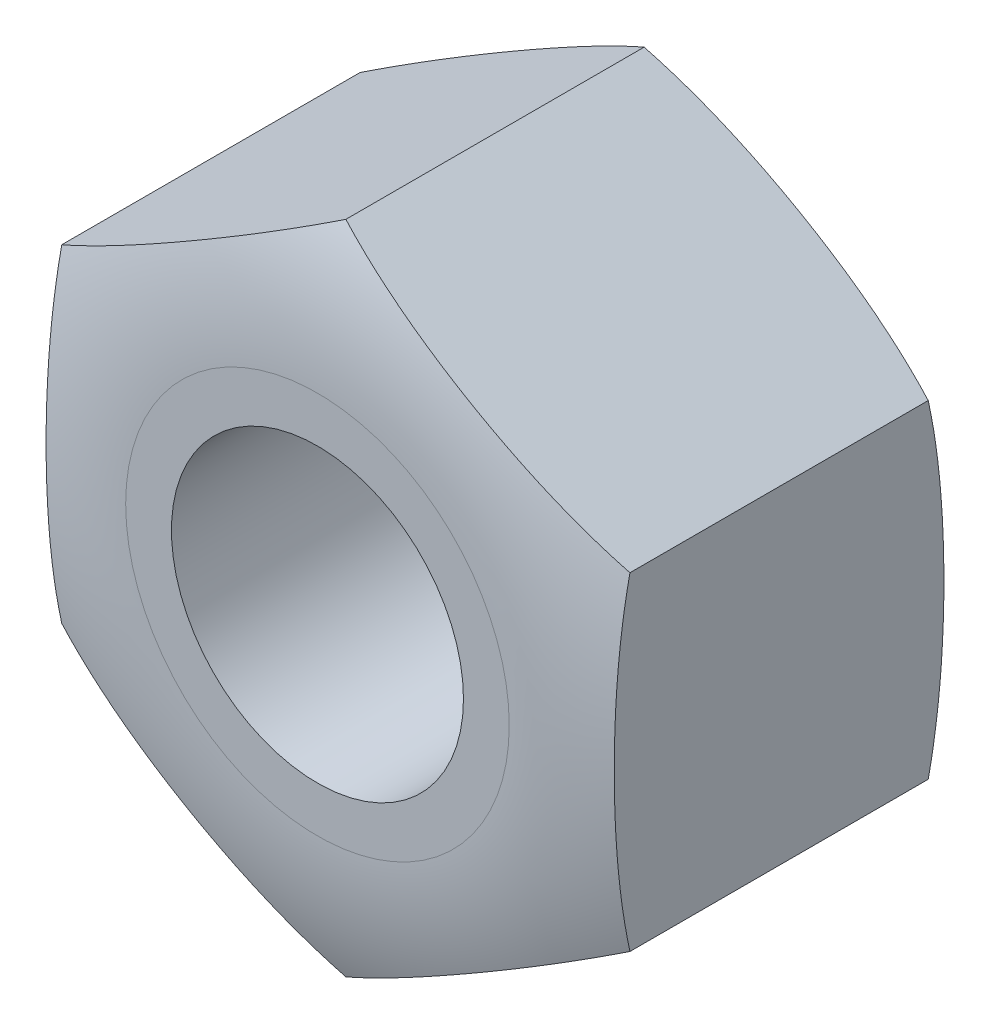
ISO-10303-21;
HEADER;
FILE_DESCRIPTION(('STEP AP214'),'2;1');
FILE_NAME('part.step','',(''),(''),'','','');
FILE_SCHEMA(('AUTOMOTIVE_DESIGN { 1 0 10303 214 1 1 1 1 }'));
ENDSEC;
DATA;
#1=APPLICATION_CONTEXT('core data for automotive mechanical design processes');
#2=APPLICATION_PROTOCOL_DEFINITION('international standard','automotive_design',2000,#1);
#3=PRODUCT_CONTEXT('',#1,'mechanical');
#4=PRODUCT('Part','Part','',(#3));
#5=PRODUCT_RELATED_PRODUCT_CATEGORY('part','',(#4));
#6=PRODUCT_DEFINITION_FORMATION('','',#4);
#7=PRODUCT_DEFINITION_CONTEXT('part definition',#1,'design');
#8=PRODUCT_DEFINITION('design','',#6,#7);
#9=PRODUCT_DEFINITION_SHAPE('','',#8);
#10=(LENGTH_UNIT() NAMED_UNIT(*) SI_UNIT(.MILLI.,.METRE.));
#11=(NAMED_UNIT(*) PLANE_ANGLE_UNIT() SI_UNIT($,.RADIAN.));
#12=(NAMED_UNIT(*) SI_UNIT($,.STERADIAN.) SOLID_ANGLE_UNIT());
#13=UNCERTAINTY_MEASURE_WITH_UNIT(LENGTH_MEASURE(1.E-05),#10,'distance_accuracy_value','');
#14=(GEOMETRIC_REPRESENTATION_CONTEXT(3) GLOBAL_UNCERTAINTY_ASSIGNED_CONTEXT((#13)) GLOBAL_UNIT_ASSIGNED_CONTEXT((#10,
#11,#12)) REPRESENTATION_CONTEXT('',''));
#15=CARTESIAN_POINT('',(0.,0.,0.));
#16=DIRECTION('',(0.,0.,1.));
#17=DIRECTION('',(1.,0.,0.));
#18=AXIS2_PLACEMENT_3D('',#15,#16,#17);
#19=CARTESIAN_POINT('',(6.35,3.66617420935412,-3.96875));
#20=DIRECTION('',(0.,0.,1.));
#21=DIRECTION('',(1.,0.,0.));
#22=AXIS2_PLACEMENT_3D('',#19,#20,#21);
#23=PLANE('',#22);
#24=CARTESIAN_POINT('',(0.,0.,-3.96875));
#25=DIRECTION('',(0.,0.,1.));
#26=DIRECTION('',(1.,0.,0.));
#27=AXIS2_PLACEMENT_3D('',#24,#25,#26);
#28=CIRCLE('',#27,3.2639);
#29=CARTESIAN_POINT('',(3.2639,0.,-3.96875));
#30=VERTEX_POINT('',#29);
#31=EDGE_CURVE('E116',#30,#30,#28,.T.);
#32=ORIENTED_EDGE('',*,*,#31,.T.);
#33=EDGE_LOOP('',(#32));
#34=FACE_BOUND('',#33,.T.);
#35=CARTESIAN_POINT('',(0.,0.,-3.96875));
#36=DIRECTION('',(0.,0.,-1.));
#37=DIRECTION('',(-1.,0.,0.));
#38=AXIS2_PLACEMENT_3D('',#35,#36,#37);
#39=CIRCLE('',#38,4.28699540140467);
#40=CARTESIAN_POINT('',(-4.28699540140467,0.,-3.96875));
#41=VERTEX_POINT('',#40);
#42=EDGE_CURVE('E197',#41,#41,#39,.T.);
#43=ORIENTED_EDGE('',*,*,#42,.T.);
#44=EDGE_LOOP('',(#43));
#45=FACE_BOUND('',#44,.T.);
#46=ADVANCED_FACE('F30',(#34,#45),#23,.F.);
#47=CARTESIAN_POINT('',(6.35,3.66617420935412,3.96875));
#48=DIRECTION('',(0.,0.,1.));
#49=DIRECTION('',(1.,0.,0.));
#50=AXIS2_PLACEMENT_3D('',#47,#48,#49);
#51=PLANE('',#50);
#52=CARTESIAN_POINT('',(0.,0.,3.96875));
#53=DIRECTION('',(0.,0.,1.));
#54=DIRECTION('',(1.,0.,0.));
#55=AXIS2_PLACEMENT_3D('',#52,#53,#54);
#56=CIRCLE('',#55,3.2639);
#57=CARTESIAN_POINT('',(3.2639,0.,3.96875));
#58=VERTEX_POINT('',#57);
#59=EDGE_CURVE('E119',#58,#58,#56,.T.);
#60=ORIENTED_EDGE('',*,*,#59,.F.);
#61=EDGE_LOOP('',(#60));
#62=FACE_BOUND('',#61,.T.);
#63=CARTESIAN_POINT('',(0.,0.,3.96875));
#64=DIRECTION('',(0.,0.,-1.));
#65=DIRECTION('',(-1.,0.,0.));
#66=AXIS2_PLACEMENT_3D('',#63,#64,#65);
#67=CIRCLE('',#66,4.28699540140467);
#68=CARTESIAN_POINT('',(-4.28699540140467,0.,3.96875));
#69=VERTEX_POINT('',#68);
#70=EDGE_CURVE('E187',#69,#69,#67,.T.);
#71=ORIENTED_EDGE('',*,*,#70,.F.);
#72=EDGE_LOOP('',(#71));
#73=FACE_BOUND('',#72,.T.);
#74=ADVANCED_FACE('F207',(#62,#73),#51,.T.);
#75=CARTESIAN_POINT('',(6.35,-3.66617420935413,3.96875));
#76=DIRECTION('',(-1.,0.,0.));
#77=DIRECTION('',(0.,-1.,0.));
#78=AXIS2_PLACEMENT_3D('',#75,#76,#77);
#79=PLANE('',#78);
#80=DIRECTION('',(0.,0.,-1.));
#81=VECTOR('',#80,1.);
#82=CARTESIAN_POINT('',(6.35,-3.66617420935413,3.96875));
#83=LINE('',#82,#81);
#84=CARTESIAN_POINT('',(6.34999999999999,-3.66617420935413,3.33375));
#85=VERTEX_POINT('',#84);
#86=CARTESIAN_POINT('',(6.35,-3.66617420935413,-3.33375));
#87=VERTEX_POINT('',#86);
#88=EDGE_CURVE('E113',#85,#87,#83,.T.);
#89=ORIENTED_EDGE('',*,*,#88,.T.);
#90=CARTESIAN_POINT('',(6.35,0.,-3.68417173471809));
#91=CARTESIAN_POINT('',(6.35,0.190043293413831,-3.68417149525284));
#92=CARTESIAN_POINT('',(6.35,0.380086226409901,-3.68178309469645));
#93=CARTESIAN_POINT('',(6.35,0.760047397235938,-3.67210017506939));
#94=CARTESIAN_POINT('',(6.35,0.949965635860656,-3.66480568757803));
#95=CARTESIAN_POINT('',(6.35,1.32957505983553,-3.64493744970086));
#96=CARTESIAN_POINT('',(6.35,1.51926618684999,-3.63236255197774));
#97=CARTESIAN_POINT('',(6.35,1.89816546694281,-3.60135471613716));
#98=CARTESIAN_POINT('',(6.35,2.08737361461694,-3.58292171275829));
#99=CARTESIAN_POINT('',(6.35,2.65158287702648,-3.51802974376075));
#100=CARTESIAN_POINT('',(6.35,3.02555185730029,-3.46186998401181));
#101=CARTESIAN_POINT('',(6.35,3.76709775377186,-3.31706662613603));
#102=CARTESIAN_POINT('',(6.35,4.13467968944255,-3.22844986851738));
#103=CARTESIAN_POINT('',(6.35,4.71918815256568,-3.05418669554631));
#104=CARTESIAN_POINT('',(6.35,4.93969386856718,-2.98050148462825));
#105=CARTESIAN_POINT('',(6.35,5.37480029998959,-2.81744768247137));
#106=CARTESIAN_POINT('',(6.35,5.58940289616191,-2.72808415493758));
#107=CARTESIAN_POINT('',(6.35,6.01116177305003,-2.53277446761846));
#108=CARTESIAN_POINT('',(6.35,6.21831218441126,-2.426815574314));
#109=CARTESIAN_POINT('',(6.35,6.6230523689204,-2.19792319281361));
#110=CARTESIAN_POINT('',(6.35,6.82064213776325,-2.07498969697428));
#111=CARTESIAN_POINT('',(6.35,7.20593559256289,-1.81090820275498));
#112=CARTESIAN_POINT('',(6.35,7.39353330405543,-1.66960504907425));
#113=CARTESIAN_POINT('',(6.35,7.75471253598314,-1.37003946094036));
#114=CARTESIAN_POINT('',(6.35,7.92829353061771,-1.2117763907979));
#115=CARTESIAN_POINT('',(6.35,8.25920479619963,-0.879157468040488));
#116=CARTESIAN_POINT('',(6.35,8.41654028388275,-0.70480681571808));
#117=CARTESIAN_POINT('',(6.35,8.71292186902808,-0.341199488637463));
#118=CARTESIAN_POINT('',(6.35,8.85197079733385,-0.15194512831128));
#119=CARTESIAN_POINT('',(6.35,9.09366830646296,0.215256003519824));
#120=CARTESIAN_POINT('',(6.35,9.1986950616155,0.391641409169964));
#121=CARTESIAN_POINT('',(6.35,9.39214754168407,0.753290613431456));
#122=CARTESIAN_POINT('',(6.35,9.48057487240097,0.938553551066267));
#123=CARTESIAN_POINT('',(6.35,9.63979421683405,1.31640270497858));
#124=CARTESIAN_POINT('',(6.35,9.71059505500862,1.50898520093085));
#125=CARTESIAN_POINT('',(6.35,9.83380231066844,1.8999470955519));
#126=CARTESIAN_POINT('',(6.35,9.88620984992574,2.09832613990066));
#127=CARTESIAN_POINT('',(6.35,9.96817980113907,2.48119512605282));
#128=CARTESIAN_POINT('',(6.35,9.99936712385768,2.66533896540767));
#129=CARTESIAN_POINT('',(6.35,10.0456883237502,3.03563114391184));
#130=CARTESIAN_POINT('',(6.35,10.060823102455,3.22177936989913));
#131=CARTESIAN_POINT('',(6.35,10.0748899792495,3.59465250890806));
#132=CARTESIAN_POINT('',(6.35,10.0738249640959,3.78137731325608));
#133=CARTESIAN_POINT('',(6.35,10.0555099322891,4.15403248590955));
#134=CARTESIAN_POINT('',(6.35,10.0382599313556,4.33996285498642));
#135=CARTESIAN_POINT('',(6.35,9.98843480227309,4.70458843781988));
#136=CARTESIAN_POINT('',(6.35,9.95629034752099,4.88334269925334));
#137=CARTESIAN_POINT('',(6.35,9.87713293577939,5.23759057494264));
#138=CARTESIAN_POINT('',(6.35,9.83011496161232,5.41308306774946));
#139=CARTESIAN_POINT('',(6.35,9.72167668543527,5.75944393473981));
#140=CARTESIAN_POINT('',(6.35,9.66026480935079,5.93031494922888));
#141=CARTESIAN_POINT('',(6.35,9.52354912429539,6.26648878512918));
#142=CARTESIAN_POINT('',(6.35,9.4482391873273,6.43178911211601));
#143=CARTESIAN_POINT('',(6.35,9.28336934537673,6.75777112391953));
#144=CARTESIAN_POINT('',(6.35,9.19364006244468,6.91836709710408));
#145=CARTESIAN_POINT('',(6.35,9.00147531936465,7.23167378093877));
#146=CARTESIAN_POINT('',(6.35,8.899044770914,7.3843875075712));
#147=CARTESIAN_POINT('',(6.35,8.68224238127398,7.68128647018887));
#148=CARTESIAN_POINT('',(6.35,8.56786013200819,7.82546409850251));
#149=CARTESIAN_POINT('',(6.35,8.32822339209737,8.10440220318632));
#150=CARTESIAN_POINT('',(6.35,8.20297169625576,8.23916508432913));
#151=CARTESIAN_POINT('',(6.35,7.93539582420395,8.50592101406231));
#152=CARTESIAN_POINT('',(6.35,7.79251109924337,8.63735165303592));
#153=CARTESIAN_POINT('',(6.35,7.49696015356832,8.88868663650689));
#154=CARTESIAN_POINT('',(6.35,7.34429386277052,9.00859089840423));
#155=CARTESIAN_POINT('',(6.35,7.03062669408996,9.23645150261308));
#156=CARTESIAN_POINT('',(6.35,6.86963762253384,9.34442412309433));
#157=CARTESIAN_POINT('',(6.35,6.54032798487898,9.54855955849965));
#158=CARTESIAN_POINT('',(6.35,6.37200602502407,9.64472011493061));
#159=CARTESIAN_POINT('',(6.35,5.95482478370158,9.86452406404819));
#160=CARTESIAN_POINT('',(6.35,5.70269784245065,9.9819987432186));
#161=CARTESIAN_POINT('',(6.35,5.18894784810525,10.1939197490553));
#162=CARTESIAN_POINT('',(6.35,4.92732124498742,10.2883573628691));
#163=CARTESIAN_POINT('',(6.35,4.39591063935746,10.4563920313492));
#164=CARTESIAN_POINT('',(6.35,4.12608913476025,10.5298693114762));
#165=CARTESIAN_POINT('',(6.35,3.58203581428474,10.6575893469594));
#166=CARTESIAN_POINT('',(6.35,3.3078045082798,10.7118343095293));
#167=CARTESIAN_POINT('',(6.35,2.77104519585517,10.8013352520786));
#168=CARTESIAN_POINT('',(6.35,2.50865479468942,10.8374356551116));
#169=CARTESIAN_POINT('',(6.35,1.98240580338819,10.8969695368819));
#170=CARTESIAN_POINT('',(6.35,1.71854685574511,10.9203997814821));
#171=CARTESIAN_POINT('',(6.35,1.18967444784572,10.9564927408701));
#172=CARTESIAN_POINT('',(6.35,0.924659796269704,10.9691374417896));
#173=CARTESIAN_POINT('',(6.35,0.394377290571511,10.9848214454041));
#174=CARTESIAN_POINT('',(6.35,0.12910945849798,10.987861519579));
#175=CARTESIAN_POINT('',(6.35,-0.400967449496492,10.9846634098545));
#176=CARTESIAN_POINT('',(6.35,-0.66577660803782,10.9784393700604));
#177=CARTESIAN_POINT('',(6.35,-1.19501299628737,10.9560911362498));
#178=CARTESIAN_POINT('',(6.35,-1.4594401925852,10.9399661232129));
#179=CARTESIAN_POINT('',(6.35,-1.98689127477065,10.8963747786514));
#180=CARTESIAN_POINT('',(6.35,-2.2499168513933,10.8689294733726));
#181=CARTESIAN_POINT('',(6.35,-2.77421921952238,10.8006790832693));
#182=CARTESIAN_POINT('',(6.35,-3.0354963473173,10.7598766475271));
#183=CARTESIAN_POINT('',(6.35,-3.53499246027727,10.6664377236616));
#184=CARTESIAN_POINT('',(6.35,-3.77342668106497,10.6149660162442));
#185=CARTESIAN_POINT('',(6.35,-4.24661725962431,10.4970224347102));
#186=CARTESIAN_POINT('',(6.35,-4.48137336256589,10.4305495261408));
#187=CARTESIAN_POINT('',(6.35,-4.9449777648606,10.2813051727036));
#188=CARTESIAN_POINT('',(6.35,-5.17384055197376,10.1985791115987));
#189=CARTESIAN_POINT('',(6.35,-5.62442043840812,10.0155635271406));
#190=CARTESIAN_POINT('',(6.35,-5.84613908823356,9.91527784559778));
#191=CARTESIAN_POINT('',(6.35,-6.28306955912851,9.69500662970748));
#192=CARTESIAN_POINT('',(6.35,-6.49816670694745,9.5747923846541));
#193=CARTESIAN_POINT('',(6.35,-6.91655563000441,9.31524156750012));
#194=CARTESIAN_POINT('',(6.35,-7.11984703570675,9.17590439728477));
#195=CARTESIAN_POINT('',(6.35,-7.5123137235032,8.87815721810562));
#196=CARTESIAN_POINT('',(6.35,-7.70147463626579,8.7197282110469));
#197=CARTESIAN_POINT('',(6.35,-8.06290226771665,8.3846354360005));
#198=CARTESIAN_POINT('',(6.35,-8.23517150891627,8.20797439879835));
#199=CARTESIAN_POINT('',(6.35,-8.54187305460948,7.85871125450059));
#200=CARTESIAN_POINT('',(6.35,-8.67838047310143,7.68792880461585));
#201=CARTESIAN_POINT('',(6.35,-8.93458225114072,7.33419021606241));
#202=CARTESIAN_POINT('',(6.35,-9.05427871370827,7.15123560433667));
#203=CARTESIAN_POINT('',(6.35,-9.27529325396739,6.77476513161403));
#204=CARTESIAN_POINT('',(6.35,-9.37662842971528,6.58125931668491));
#205=CARTESIAN_POINT('',(6.35,-9.55976952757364,6.18522013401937));
#206=CARTESIAN_POINT('',(6.35,-9.64157765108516,5.98268778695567));
#207=CARTESIAN_POINT('',(6.35,-9.77569259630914,5.5962012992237));
#208=CARTESIAN_POINT('',(6.35,-9.83040562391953,5.41307815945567));
#209=CARTESIAN_POINT('',(6.35,-9.92351683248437,5.04273548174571));
#210=CARTESIAN_POINT('',(6.35,-9.96191643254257,4.85551630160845));
#211=CARTESIAN_POINT('',(6.35,-10.0220039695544,4.47845973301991));
#212=CARTESIAN_POINT('',(6.35,-10.0436957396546,4.28862295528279));
#213=CARTESIAN_POINT('',(6.35,-10.0701597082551,3.90777153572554));
#214=CARTESIAN_POINT('',(6.35,-10.0749320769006,3.71675690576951));
#215=CARTESIAN_POINT('',(6.35,-10.0676778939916,3.3437118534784));
#216=CARTESIAN_POINT('',(6.35,-10.0564024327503,3.16166637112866));
#217=CARTESIAN_POINT('',(6.35,-10.018487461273,2.7991195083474));
#218=CARTESIAN_POINT('',(6.35,-9.99184280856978,2.61861866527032));
#219=CARTESIAN_POINT('',(6.35,-9.92345263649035,2.26060221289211));
#220=CARTESIAN_POINT('',(6.35,-9.88171506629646,2.08308508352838));
#221=CARTESIAN_POINT('',(6.35,-9.78350235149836,1.73209359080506));
#222=CARTESIAN_POINT('',(6.35,-9.72702067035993,1.55862105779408));
#223=CARTESIAN_POINT('',(6.35,-9.59984032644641,1.21695347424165));
#224=CARTESIAN_POINT('',(6.35,-9.52914027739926,1.04875894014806));
#225=CARTESIAN_POINT('',(6.35,-9.37419690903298,0.718818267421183));
#226=CARTESIAN_POINT('',(6.35,-9.28995914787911,0.557069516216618));
#227=CARTESIAN_POINT('',(6.35,-9.1086269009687,0.240865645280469));
#228=CARTESIAN_POINT('',(6.35,-9.01152718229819,0.0864135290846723));
#229=CARTESIAN_POINT('',(6.35,-8.80536513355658,-0.214215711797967));
#230=CARTESIAN_POINT('',(6.35,-8.69630609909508,-0.360395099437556));
#231=CARTESIAN_POINT('',(6.35,-8.4626329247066,-0.649328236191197));
#232=CARTESIAN_POINT('',(6.35,-8.33757752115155,-0.791725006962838));
#233=CARTESIAN_POINT('',(6.35,-8.07659710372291,-1.06616977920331));
#234=CARTESIAN_POINT('',(6.35,-7.94067187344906,-1.19821757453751));
#235=CARTESIAN_POINT('',(6.35,-7.65906962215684,-1.45147988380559));
#236=CARTESIAN_POINT('',(6.35,-7.5133917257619,-1.57269342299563));
#237=CARTESIAN_POINT('',(6.35,-7.21343222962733,-1.80396744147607));
#238=CARTESIAN_POINT('',(6.35,-7.05914973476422,-1.91402675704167));
#239=CARTESIAN_POINT('',(6.35,-6.72838593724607,-2.13258802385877));
#240=CARTESIAN_POINT('',(6.35,-6.55117628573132,-2.23998733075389));
#241=CARTESIAN_POINT('',(6.35,-6.18929535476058,-2.44134865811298));
#242=CARTESIAN_POINT('',(6.35,-6.00462359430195,-2.53530981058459));
#243=CARTESIAN_POINT('',(6.35,-5.62928327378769,-2.71006637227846));
#244=CARTESIAN_POINT('',(6.35,-5.43861775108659,-2.79086832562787));
#245=CARTESIAN_POINT('',(6.35,-5.05242811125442,-2.93993283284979));
#246=CARTESIAN_POINT('',(6.35,-4.8569027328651,-3.00819209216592));
#247=CARTESIAN_POINT('',(6.35,-4.28613219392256,-3.18847449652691));
#248=CARTESIAN_POINT('',(6.35,-3.90603604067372,-3.28527594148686));
#249=CARTESIAN_POINT('',(6.35,-3.13840810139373,-3.44319896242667));
#250=CARTESIAN_POINT('',(6.35,-2.75086871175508,-3.50428180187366));
#251=CARTESIAN_POINT('',(6.35,-2.16587013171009,-3.57471847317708));
#252=CARTESIAN_POINT('',(6.35,-1.9695937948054,-3.59469696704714));
#253=CARTESIAN_POINT('',(6.35,-1.57648986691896,-3.62826447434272));
#254=CARTESIAN_POINT('',(6.35,-1.3796622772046,-3.6418535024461));
#255=CARTESIAN_POINT('',(6.35,-0.985764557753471,-3.66330361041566));
#256=CARTESIAN_POINT('',(6.35,-0.788694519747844,-3.67116642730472));
#257=CARTESIAN_POINT('',(6.35,-0.394416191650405,-3.68160060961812));
#258=CARTESIAN_POINT('',(6.35,-0.197207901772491,-3.68417198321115));
#259=CARTESIAN_POINT('',(6.35,0.,-3.68417173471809));
#260=B_SPLINE_CURVE_WITH_KNOTS('',3,(#90,#91,#92,#93,#94,#95,#96,#97,#98,#99,#100,#101,#102,
#103,#104,#105,#106,#107,#108,#109,#110,#111,#112,#113,#114,#115,#116,#117,#118,#119,#120,#121,
#122,#123,#124,#125,#126,#127,#128,#129,#130,#131,#132,#133,#134,#135,#136,#137,#138,#139,#140,
#141,#142,#143,#144,#145,#146,#147,#148,#149,#150,#151,#152,#153,#154,#155,#156,#157,#158,#159,
#160,#161,#162,#163,#164,#165,#166,#167,#168,#169,#170,#171,#172,#173,#174,#175,#176,#177,#178,
#179,#180,#181,#182,#183,#184,#185,#186,#187,#188,#189,#190,#191,#192,#193,#194,#195,#196,#197,
#198,#199,#200,#201,#202,#203,#204,#205,#206,#207,#208,#209,#210,#211,#212,#213,#214,#215,#216,
#217,#218,#219,#220,#221,#222,#223,#224,#225,#226,#227,#228,#229,#230,#231,#232,#233,#234,#235,
#236,#237,#238,#239,#240,#241,#242,#243,#244,#245,#246,#247,#248,#249,#250,#251,#252,#253,#254,
#255,#256,#257,#258,#259),.UNSPECIFIED.,.T.,.F.,(4,2,2,2,2,2,2,2,2,2,2,2,2,2,2,2,2,2,2,2,2,2,2,
2,2,2,2,2,2,2,2,2,2,2,2,2,2,2,2,2,2,2,2,2,2,2,2,2,2,2,2,2,2,2,2,2,2,2,2,2,2,2,2,2,2,2,2,2,2,2,2,
2,2,2,2,2,2,2,2,2,2,2,2,2,4),(0.,0.570113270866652,1.14022287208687,1.71045641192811,
2.28069630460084,3.41403346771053,4.5464355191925,5.24339115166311,5.94012209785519,
6.63739028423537,7.33465878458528,8.03825425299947,8.74187610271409,9.44527129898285,
10.1485574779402,10.763587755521,11.378558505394,11.9932207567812,12.6078455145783,
13.1674581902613,13.7270394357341,14.2865209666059,14.8460019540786,15.3902283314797,
15.9346384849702,16.4787307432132,17.0230634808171,17.5743335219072,18.1253910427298,
18.676932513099,19.2283325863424,19.8101351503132,20.3919418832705,20.9729448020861,
21.554058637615,22.3872081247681,23.2206722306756,24.0588077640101,24.8968470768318,
25.6910773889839,26.4855103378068,27.2812675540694,28.0769608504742,28.8714405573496,
29.6659859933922,30.4590622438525,31.2519813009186,31.9833368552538,32.7147428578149,
33.4441348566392,34.1733674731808,34.9116363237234,35.6499282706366,36.3889610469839,
37.1278832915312,37.7828445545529,38.4377238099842,39.0919900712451,39.7461825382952,
40.3188318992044,40.8914314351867,41.4638995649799,42.036361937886,42.5828955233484,
43.1296120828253,43.6760411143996,44.2227128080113,44.7694378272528,45.3159389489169,
45.8626631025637,46.4092369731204,46.9771655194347,47.5451053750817,48.1130962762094,
48.6811463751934,49.3021772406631,49.9232482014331,50.5440093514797,51.1649333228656,
52.3393045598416,53.5149470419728,54.1067353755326,54.698522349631,55.290129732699,
55.8817362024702),.UNSPECIFIED.);
#261=CARTESIAN_POINT('',(6.35,3.66617420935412,-3.33375));
#262=VERTEX_POINT('',#261);
#263=EDGE_CURVE('E46',#87,#262,#260,.T.);
#264=ORIENTED_EDGE('',*,*,#263,.T.);
#265=DIRECTION('',(0.,0.,-1.));
#266=VECTOR('',#265,1.);
#267=CARTESIAN_POINT('',(6.35,3.66617420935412,3.96875));
#268=LINE('',#267,#266);
#269=CARTESIAN_POINT('',(6.35,3.66617420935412,3.33375));
#270=VERTEX_POINT('',#269);
#271=EDGE_CURVE('E11',#270,#262,#268,.T.);
#272=ORIENTED_EDGE('',*,*,#271,.F.);
#273=CARTESIAN_POINT('',(6.35,0.,3.68417173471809));
#274=CARTESIAN_POINT('',(6.35,-0.190043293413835,3.68417149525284));
#275=CARTESIAN_POINT('',(6.35,-0.380086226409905,3.68178309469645));
#276=CARTESIAN_POINT('',(6.35,-0.760047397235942,3.67210017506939));
#277=CARTESIAN_POINT('',(6.35,-0.94996563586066,3.66480568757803));
#278=CARTESIAN_POINT('',(6.35,-1.32957505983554,3.64493744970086));
#279=CARTESIAN_POINT('',(6.35,-1.51926618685,3.63236255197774));
#280=CARTESIAN_POINT('',(6.35,-1.89816546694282,3.60135471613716));
#281=CARTESIAN_POINT('',(6.35,-2.08737361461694,3.58292171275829));
#282=CARTESIAN_POINT('',(6.35,-2.65158287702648,3.51802974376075));
#283=CARTESIAN_POINT('',(6.35,-3.02555185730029,3.46186998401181));
#284=CARTESIAN_POINT('',(6.35,-3.76709775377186,3.31706662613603));
#285=CARTESIAN_POINT('',(6.35,-4.13467968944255,3.22844986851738));
#286=CARTESIAN_POINT('',(6.35,-4.71918815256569,3.05418669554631));
#287=CARTESIAN_POINT('',(6.35,-4.93969386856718,2.98050148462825));
#288=CARTESIAN_POINT('',(6.35,-5.37480029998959,2.81744768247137));
#289=CARTESIAN_POINT('',(6.35,-5.58940289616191,2.72808415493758));
#290=CARTESIAN_POINT('',(6.35,-6.01116177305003,2.53277446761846));
#291=CARTESIAN_POINT('',(6.35,-6.21831218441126,2.426815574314));
#292=CARTESIAN_POINT('',(6.35,-6.6230523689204,2.1979231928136));
#293=CARTESIAN_POINT('',(6.35,-6.82064213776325,2.07498969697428));
#294=CARTESIAN_POINT('',(6.35,-7.20593559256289,1.81090820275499));
#295=CARTESIAN_POINT('',(6.35,-7.39353330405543,1.66960504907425));
#296=CARTESIAN_POINT('',(6.35,-7.75471253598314,1.37003946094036));
#297=CARTESIAN_POINT('',(6.35,-7.92829353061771,1.21177639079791));
#298=CARTESIAN_POINT('',(6.35,-8.25920479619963,0.87915746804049));
#299=CARTESIAN_POINT('',(6.35,-8.41654028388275,0.704806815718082));
#300=CARTESIAN_POINT('',(6.35,-8.71292186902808,0.341199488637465));
#301=CARTESIAN_POINT('',(6.35,-8.85197079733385,0.151945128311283));
#302=CARTESIAN_POINT('',(6.35,-9.09366830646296,-0.215256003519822));
#303=CARTESIAN_POINT('',(6.35,-9.1986950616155,-0.391641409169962));
#304=CARTESIAN_POINT('',(6.35,-9.39214754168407,-0.753290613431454));
#305=CARTESIAN_POINT('',(6.35,-9.48057487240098,-0.938553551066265));
#306=CARTESIAN_POINT('',(6.35,-9.63979421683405,-1.31640270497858));
#307=CARTESIAN_POINT('',(6.35,-9.71059505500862,-1.50898520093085));
#308=CARTESIAN_POINT('',(6.35,-9.83380231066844,-1.8999470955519));
#309=CARTESIAN_POINT('',(6.35,-9.88620984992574,-2.09832613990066));
#310=CARTESIAN_POINT('',(6.35,-9.96817980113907,-2.48119512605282));
#311=CARTESIAN_POINT('',(6.35,-9.99936712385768,-2.66533896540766));
#312=CARTESIAN_POINT('',(6.35,-10.0456883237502,-3.03563114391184));
#313=CARTESIAN_POINT('',(6.35,-10.060823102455,-3.22177936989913));
#314=CARTESIAN_POINT('',(6.35,-10.0748899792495,-3.59465250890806));
#315=CARTESIAN_POINT('',(6.35,-10.0738249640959,-3.78137731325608));
#316=CARTESIAN_POINT('',(6.35,-10.0555099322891,-4.15403248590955));
#317=CARTESIAN_POINT('',(6.35,-10.0382599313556,-4.33996285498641));
#318=CARTESIAN_POINT('',(6.35,-9.98843480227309,-4.70458843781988));
#319=CARTESIAN_POINT('',(6.35,-9.95629034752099,-4.88334269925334));
#320=CARTESIAN_POINT('',(6.35,-9.87713293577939,-5.23759057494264));
#321=CARTESIAN_POINT('',(6.35,-9.83011496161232,-5.41308306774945));
#322=CARTESIAN_POINT('',(6.35,-9.72167668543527,-5.75944393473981));
#323=CARTESIAN_POINT('',(6.35,-9.66026480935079,-5.93031494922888));
#324=CARTESIAN_POINT('',(6.35,-9.52354912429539,-6.26648878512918));
#325=CARTESIAN_POINT('',(6.35,-9.4482391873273,-6.43178911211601));
#326=CARTESIAN_POINT('',(6.35,-9.28336934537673,-6.75777112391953));
#327=CARTESIAN_POINT('',(6.35,-9.19364006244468,-6.91836709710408));
#328=CARTESIAN_POINT('',(6.35,-9.00147531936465,-7.23167378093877));
#329=CARTESIAN_POINT('',(6.35,-8.899044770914,-7.3843875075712));
#330=CARTESIAN_POINT('',(6.35,-8.68224238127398,-7.68128647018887));
#331=CARTESIAN_POINT('',(6.35,-8.56786013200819,-7.82546409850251));
#332=CARTESIAN_POINT('',(6.35,-8.32822339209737,-8.10440220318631));
#333=CARTESIAN_POINT('',(6.35,-8.20297169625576,-8.23916508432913));
#334=CARTESIAN_POINT('',(6.35,-7.93539582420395,-8.50592101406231));
#335=CARTESIAN_POINT('',(6.35,-7.79251109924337,-8.63735165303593));
#336=CARTESIAN_POINT('',(6.35,-7.49696015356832,-8.88868663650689));
#337=CARTESIAN_POINT('',(6.35,-7.34429386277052,-9.00859089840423));
#338=CARTESIAN_POINT('',(6.35,-7.03062669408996,-9.23645150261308));
#339=CARTESIAN_POINT('',(6.35,-6.86963762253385,-9.34442412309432));
#340=CARTESIAN_POINT('',(6.35,-6.54032798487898,-9.54855955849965));
#341=CARTESIAN_POINT('',(6.35,-6.37200602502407,-9.6447201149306));
#342=CARTESIAN_POINT('',(6.35,-5.95482478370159,-9.86452406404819));
#343=CARTESIAN_POINT('',(6.35,-5.70269784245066,-9.98199874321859));
#344=CARTESIAN_POINT('',(6.35,-5.18894784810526,-10.1939197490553));
#345=CARTESIAN_POINT('',(6.35,-4.92732124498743,-10.2883573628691));
#346=CARTESIAN_POINT('',(6.35,-4.39591063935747,-10.4563920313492));
#347=CARTESIAN_POINT('',(6.35,-4.12608913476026,-10.5298693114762));
#348=CARTESIAN_POINT('',(6.35,-3.58203581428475,-10.6575893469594));
#349=CARTESIAN_POINT('',(6.35,-3.3078045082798,-10.7118343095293));
#350=CARTESIAN_POINT('',(6.35,-2.77104519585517,-10.8013352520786));
#351=CARTESIAN_POINT('',(6.35,-2.50865479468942,-10.8374356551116));
#352=CARTESIAN_POINT('',(6.35,-1.98240580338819,-10.8969695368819));
#353=CARTESIAN_POINT('',(6.35,-1.71854685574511,-10.9203997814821));
#354=CARTESIAN_POINT('',(6.35,-1.18967444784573,-10.9564927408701));
#355=CARTESIAN_POINT('',(6.35,-0.924659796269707,-10.9691374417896));
#356=CARTESIAN_POINT('',(6.35,-0.394377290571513,-10.9848214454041));
#357=CARTESIAN_POINT('',(6.35,-0.129109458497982,-10.987861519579));
#358=CARTESIAN_POINT('',(6.35,0.400967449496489,-10.9846634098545));
#359=CARTESIAN_POINT('',(6.35,0.665776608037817,-10.9784393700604));
#360=CARTESIAN_POINT('',(6.35,1.19501299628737,-10.9560911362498));
#361=CARTESIAN_POINT('',(6.35,1.45944019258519,-10.9399661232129));
#362=CARTESIAN_POINT('',(6.35,1.98689127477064,-10.8963747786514));
#363=CARTESIAN_POINT('',(6.35,2.2499168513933,-10.8689294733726));
#364=CARTESIAN_POINT('',(6.35,2.77421921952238,-10.8006790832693));
#365=CARTESIAN_POINT('',(6.35,3.03549634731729,-10.7598766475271));
#366=CARTESIAN_POINT('',(6.35,3.53499246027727,-10.6664377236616));
#367=CARTESIAN_POINT('',(6.35,3.77342668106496,-10.6149660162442));
#368=CARTESIAN_POINT('',(6.35,4.2466172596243,-10.4970224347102));
#369=CARTESIAN_POINT('',(6.35,4.48137336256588,-10.4305495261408));
#370=CARTESIAN_POINT('',(6.35,4.9449777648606,-10.2813051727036));
#371=CARTESIAN_POINT('',(6.35,5.17384055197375,-10.1985791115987));
#372=CARTESIAN_POINT('',(6.35,5.62442043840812,-10.0155635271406));
#373=CARTESIAN_POINT('',(6.35,5.84613908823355,-9.91527784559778));
#374=CARTESIAN_POINT('',(6.35,6.28306955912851,-9.69500662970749));
#375=CARTESIAN_POINT('',(6.35,6.49816670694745,-9.5747923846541));
#376=CARTESIAN_POINT('',(6.35,6.9165556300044,-9.31524156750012));
#377=CARTESIAN_POINT('',(6.35,7.11984703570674,-9.17590439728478));
#378=CARTESIAN_POINT('',(6.35,7.51231372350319,-8.87815721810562));
#379=CARTESIAN_POINT('',(6.35,7.70147463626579,-8.71972821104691));
#380=CARTESIAN_POINT('',(6.35,8.06290226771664,-8.38463543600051));
#381=CARTESIAN_POINT('',(6.35,8.23517150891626,-8.20797439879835));
#382=CARTESIAN_POINT('',(6.35,8.54187305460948,-7.85871125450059));
#383=CARTESIAN_POINT('',(6.35,8.67838047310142,-7.68792880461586));
#384=CARTESIAN_POINT('',(6.35,8.93458225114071,-7.33419021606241));
#385=CARTESIAN_POINT('',(6.35,9.05427871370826,-7.15123560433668));
#386=CARTESIAN_POINT('',(6.35,9.27529325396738,-6.77476513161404));
#387=CARTESIAN_POINT('',(6.35,9.37662842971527,-6.58125931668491));
#388=CARTESIAN_POINT('',(6.35,9.55976952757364,-6.18522013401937));
#389=CARTESIAN_POINT('',(6.35,9.64157765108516,-5.98268778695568));
#390=CARTESIAN_POINT('',(6.35,9.77569259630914,-5.5962012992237));
#391=CARTESIAN_POINT('',(6.35,9.83040562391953,-5.41307815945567));
#392=CARTESIAN_POINT('',(6.35,9.92351683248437,-5.04273548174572));
#393=CARTESIAN_POINT('',(6.35,9.96191643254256,-4.85551630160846));
#394=CARTESIAN_POINT('',(6.35,10.0220039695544,-4.47845973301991));
#395=CARTESIAN_POINT('',(6.35,10.0436957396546,-4.2886229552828));
#396=CARTESIAN_POINT('',(6.35,10.0701597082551,-3.90777153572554));
#397=CARTESIAN_POINT('',(6.35,10.0749320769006,-3.71675690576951));
#398=CARTESIAN_POINT('',(6.35,10.0676778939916,-3.3437118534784));
#399=CARTESIAN_POINT('',(6.35,10.0564024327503,-3.16166637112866));
#400=CARTESIAN_POINT('',(6.35,10.018487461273,-2.7991195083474));
#401=CARTESIAN_POINT('',(6.35,9.99184280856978,-2.61861866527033));
#402=CARTESIAN_POINT('',(6.35,9.92345263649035,-2.26060221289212));
#403=CARTESIAN_POINT('',(6.35,9.88171506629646,-2.08308508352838));
#404=CARTESIAN_POINT('',(6.35,9.78350235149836,-1.73209359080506));
#405=CARTESIAN_POINT('',(6.35,9.72702067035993,-1.55862105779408));
#406=CARTESIAN_POINT('',(6.35,9.59984032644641,-1.21695347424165));
#407=CARTESIAN_POINT('',(6.35,9.52914027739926,-1.04875894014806));
#408=CARTESIAN_POINT('',(6.35,9.37419690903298,-0.718818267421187));
#409=CARTESIAN_POINT('',(6.35,9.28995914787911,-0.557069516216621));
#410=CARTESIAN_POINT('',(6.35,9.10862690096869,-0.24086564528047));
#411=CARTESIAN_POINT('',(6.35,9.01152718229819,-0.086413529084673));
#412=CARTESIAN_POINT('',(6.35,8.80536513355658,0.214215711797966));
#413=CARTESIAN_POINT('',(6.35,8.69630609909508,0.360395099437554));
#414=CARTESIAN_POINT('',(6.35,8.4626329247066,0.649328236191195));
#415=CARTESIAN_POINT('',(6.35,8.33757752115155,0.791725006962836));
#416=CARTESIAN_POINT('',(6.35,8.07659710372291,1.06616977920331));
#417=CARTESIAN_POINT('',(6.35,7.94067187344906,1.19821757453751));
#418=CARTESIAN_POINT('',(6.35,7.65906962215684,1.45147988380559));
#419=CARTESIAN_POINT('',(6.35,7.5133917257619,1.57269342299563));
#420=CARTESIAN_POINT('',(6.35,7.21343222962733,1.80396744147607));
#421=CARTESIAN_POINT('',(6.35,7.05914973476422,1.91402675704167));
#422=CARTESIAN_POINT('',(6.35,6.72838593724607,2.13258802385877));
#423=CARTESIAN_POINT('',(6.35,6.55117628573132,2.23998733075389));
#424=CARTESIAN_POINT('',(6.35,6.18929535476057,2.44134865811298));
#425=CARTESIAN_POINT('',(6.35,6.00462359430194,2.53530981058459));
#426=CARTESIAN_POINT('',(6.35,5.62928327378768,2.71006637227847));
#427=CARTESIAN_POINT('',(6.35,5.43861775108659,2.79086832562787));
#428=CARTESIAN_POINT('',(6.35,5.05242811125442,2.9399328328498));
#429=CARTESIAN_POINT('',(6.35,4.8569027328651,3.00819209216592));
#430=CARTESIAN_POINT('',(6.35,4.28613219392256,3.18847449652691));
#431=CARTESIAN_POINT('',(6.35,3.90603604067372,3.28527594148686));
#432=CARTESIAN_POINT('',(6.35,3.13840810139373,3.44319896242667));
#433=CARTESIAN_POINT('',(6.35,2.75086871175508,3.50428180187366));
#434=CARTESIAN_POINT('',(6.35,2.16587013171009,3.57471847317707));
#435=CARTESIAN_POINT('',(6.35,1.9695937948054,3.59469696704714));
#436=CARTESIAN_POINT('',(6.35,1.57648986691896,3.62826447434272));
#437=CARTESIAN_POINT('',(6.35,1.3796622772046,3.6418535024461));
#438=CARTESIAN_POINT('',(6.35,0.985764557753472,3.66330361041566));
#439=CARTESIAN_POINT('',(6.35,0.788694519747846,3.67116642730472));
#440=CARTESIAN_POINT('',(6.35,0.394416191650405,3.68160060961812));
#441=CARTESIAN_POINT('',(6.35,0.197207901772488,3.68417198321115));
#442=CARTESIAN_POINT('',(6.35,0.,3.68417173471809));
#443=B_SPLINE_CURVE_WITH_KNOTS('',3,(#273,#274,#275,#276,#277,#278,#279,#280,#281,#282,#283,
#284,#285,#286,#287,#288,#289,#290,#291,#292,#293,#294,#295,#296,#297,#298,#299,#300,#301,#302,
#303,#304,#305,#306,#307,#308,#309,#310,#311,#312,#313,#314,#315,#316,#317,#318,#319,#320,#321,
#322,#323,#324,#325,#326,#327,#328,#329,#330,#331,#332,#333,#334,#335,#336,#337,#338,#339,#340,
#341,#342,#343,#344,#345,#346,#347,#348,#349,#350,#351,#352,#353,#354,#355,#356,#357,#358,#359,
#360,#361,#362,#363,#364,#365,#366,#367,#368,#369,#370,#371,#372,#373,#374,#375,#376,#377,#378,
#379,#380,#381,#382,#383,#384,#385,#386,#387,#388,#389,#390,#391,#392,#393,#394,#395,#396,#397,
#398,#399,#400,#401,#402,#403,#404,#405,#406,#407,#408,#409,#410,#411,#412,#413,#414,#415,#416,
#417,#418,#419,#420,#421,#422,#423,#424,#425,#426,#427,#428,#429,#430,#431,#432,#433,#434,#435,
#436,#437,#438,#439,#440,#441,#442),.UNSPECIFIED.,.T.,.F.,(4,2,2,2,2,2,2,2,2,2,2,2,2,2,2,2,2,2,
2,2,2,2,2,2,2,2,2,2,2,2,2,2,2,2,2,2,2,2,2,2,2,2,2,2,2,2,2,2,2,2,2,2,2,2,2,2,2,2,2,2,2,2,2,2,2,2,
2,2,2,2,2,2,2,2,2,2,2,2,2,2,2,2,2,2,4),(0.,0.570113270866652,1.14022287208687,1.71045641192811,
2.28069630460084,3.41403346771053,4.5464355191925,5.24339115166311,5.94012209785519,
6.63739028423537,7.33465878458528,8.03825425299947,8.74187610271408,9.44527129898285,
10.1485574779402,10.763587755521,11.378558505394,11.9932207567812,12.6078455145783,
13.1674581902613,13.7270394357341,14.2865209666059,14.8460019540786,15.3902283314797,
15.9346384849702,16.4787307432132,17.0230634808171,17.5743335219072,18.1253910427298,
18.676932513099,19.2283325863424,19.8101351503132,20.3919418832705,20.9729448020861,
21.554058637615,22.3872081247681,23.2206722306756,24.0588077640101,24.8968470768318,
25.6910773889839,26.4855103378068,27.2812675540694,28.0769608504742,28.8714405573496,
29.6659859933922,30.4590622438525,31.2519813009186,31.9833368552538,32.7147428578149,
33.4441348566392,34.1733674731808,34.9116363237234,35.6499282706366,36.3889610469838,
37.1278832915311,37.7828445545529,38.4377238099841,39.0919900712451,39.7461825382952,
40.3188318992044,40.8914314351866,41.4638995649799,42.036361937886,42.5828955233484,
43.1296120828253,43.6760411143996,44.2227128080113,44.7694378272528,45.3159389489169,
45.8626631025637,46.4092369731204,46.9771655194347,47.5451053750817,48.1130962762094,
48.6811463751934,49.3021772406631,49.9232482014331,50.5440093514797,51.1649333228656,
52.3393045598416,53.5149470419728,54.1067353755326,54.698522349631,55.290129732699,
55.8817362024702),.UNSPECIFIED.);
#444=EDGE_CURVE('E122',#270,#85,#443,.T.);
#445=ORIENTED_EDGE('',*,*,#444,.T.);
#446=EDGE_LOOP('',(#89,#264,#272,#445));
#447=FACE_BOUND('',#446,.T.);
#448=ADVANCED_FACE('F32',(#447),#79,.F.);
#449=CARTESIAN_POINT('',(6.35,3.66617420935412,3.96875));
#450=DIRECTION('',(-0.5,-0.866025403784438,0.));
#451=DIRECTION('',(0.866025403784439,-0.5,0.));
#452=AXIS2_PLACEMENT_3D('',#449,#450,#451);
#453=PLANE('',#452);
#454=ORIENTED_EDGE('',*,*,#271,.T.);
#455=CARTESIAN_POINT('',(6.3502,3.66605873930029,-3.33369965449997));
#456=CARTESIAN_POINT('',(6.14208071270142,3.78621646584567,-3.3860723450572));
#457=CARTESIAN_POINT('',(5.93270116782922,3.90710180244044,-3.4312440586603));
#458=CARTESIAN_POINT('',(5.51233765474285,4.14979878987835,-3.50893059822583));
#459=CARTESIAN_POINT('',(5.30135503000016,4.27160966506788,-3.5414550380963));
#460=CARTESIAN_POINT('',(4.87823301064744,4.51589927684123,-3.59568557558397));
#461=CARTESIAN_POINT('',(4.66609290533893,4.63837842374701,-3.61738402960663));
#462=CARTESIAN_POINT('',(4.24121446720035,4.88368210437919,-3.65143249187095));
#463=CARTESIAN_POINT('',(4.02847601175,5.00650670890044,-3.66378041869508));
#464=CARTESIAN_POINT('',(3.60618062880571,5.25031906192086,-3.68000683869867));
#465=CARTESIAN_POINT('',(3.39662738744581,5.37130468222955,-3.68401796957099));
#466=CARTESIAN_POINT('',(2.97752012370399,5.61327637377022,-3.68431689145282));
#467=CARTESIAN_POINT('',(2.7679661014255,5.73426244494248,-3.68060484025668));
#468=CARTESIAN_POINT('',(2.34916289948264,5.97605858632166,-3.66513603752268));
#469=CARTESIAN_POINT('',(2.13991363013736,6.09686870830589,-3.65338258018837));
#470=CARTESIAN_POINT('',(1.72195318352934,6.33817828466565,-3.62089357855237));
#471=CARTESIAN_POINT('',(1.51324191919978,6.45867778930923,-3.60015959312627));
#472=CARTESIAN_POINT('',(1.19567412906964,6.64202563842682,-3.56061596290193));
#473=CARTESIAN_POINT('',(1.08646186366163,6.70507936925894,-3.54556761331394));
#474=CARTESIAN_POINT('',(0.868413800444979,6.83096947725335,-3.51237056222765));
#475=CARTESIAN_POINT('',(0.759577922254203,6.89380590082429,-3.49422257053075));
#476=CARTESIAN_POINT('',(0.541918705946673,7.01947150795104,-3.45449861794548));
#477=CARTESIAN_POINT('',(0.433097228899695,7.08229961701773,-3.43290897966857));
#478=CARTESIAN_POINT('',(0.215997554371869,7.20764217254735,-3.38609395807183));
#479=CARTESIAN_POINT('',(0.107719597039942,7.27015648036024,-3.36086709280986));
#480=CARTESIAN_POINT('',(-0.000199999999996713,7.33246388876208,-3.33369965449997));
#481=B_SPLINE_CURVE_WITH_KNOTS('',3,(#455,#456,#457,#458,#459,#460,#461,#462,#463,#464,#465,
#466,#467,#468,#469,#470,#471,#472,#473,#474,#475,#476,#477,#478,#479,#480),.UNSPECIFIED.,.F.,
.F.,(4,2,2,2,2,2,2,2,2,2,2,2,4),(0.,0.737597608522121,1.47463342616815,2.21218888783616,
2.94990848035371,3.67579826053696,4.4016732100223,5.12725097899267,5.85270284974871,
6.23367728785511,6.61456460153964,6.99700516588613,7.3796019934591),.UNSPECIFIED.);
#482=CARTESIAN_POINT('',(0.,7.33234841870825,-3.33375));
#483=VERTEX_POINT('',#482);
#484=EDGE_CURVE('E101',#262,#483,#481,.T.);
#485=ORIENTED_EDGE('',*,*,#484,.T.);
#486=DIRECTION('',(0.,0.,-1.));
#487=VECTOR('',#486,1.);
#488=CARTESIAN_POINT('',(0.,7.33234841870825,3.96875));
#489=LINE('',#488,#487);
#490=CARTESIAN_POINT('',(0.,7.33234841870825,3.33375));
#491=VERTEX_POINT('',#490);
#492=EDGE_CURVE('E39',#491,#483,#489,.T.);
#493=ORIENTED_EDGE('',*,*,#492,.F.);
#494=CARTESIAN_POINT('',(-0.000199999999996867,7.33246388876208,3.33369965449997));
#495=CARTESIAN_POINT('',(0.207919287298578,7.2123061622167,3.3860723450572));
#496=CARTESIAN_POINT('',(0.417298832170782,7.09142082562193,3.4312440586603));
#497=CARTESIAN_POINT('',(0.837662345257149,6.84872383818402,3.50893059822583));
#498=CARTESIAN_POINT('',(1.04864496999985,6.72691296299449,3.5414550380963));
#499=CARTESIAN_POINT('',(1.47176698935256,6.48262335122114,3.59568557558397));
#500=CARTESIAN_POINT('',(1.68390709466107,6.36014420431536,3.61738402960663));
#501=CARTESIAN_POINT('',(2.10878553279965,6.11484052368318,3.65143249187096));
#502=CARTESIAN_POINT('',(2.32152398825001,5.99201591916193,3.66378041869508));
#503=CARTESIAN_POINT('',(2.74381937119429,5.74820356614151,3.68000683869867));
#504=CARTESIAN_POINT('',(2.95337261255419,5.62721794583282,3.68401796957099));
#505=CARTESIAN_POINT('',(3.37247987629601,5.38524625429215,3.68431689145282));
#506=CARTESIAN_POINT('',(3.5820338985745,5.26426018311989,3.68060484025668));
#507=CARTESIAN_POINT('',(4.00083710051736,5.02246404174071,3.66513603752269));
#508=CARTESIAN_POINT('',(4.21008636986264,4.90165391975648,3.65338258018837));
#509=CARTESIAN_POINT('',(4.62804681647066,4.66034434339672,3.62089357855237));
#510=CARTESIAN_POINT('',(4.83675808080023,4.53984483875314,3.60015959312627));
#511=CARTESIAN_POINT('',(5.15432587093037,4.35649698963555,3.56061596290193));
#512=CARTESIAN_POINT('',(5.26353813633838,4.29344325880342,3.54556761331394));
#513=CARTESIAN_POINT('',(5.48158619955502,4.16755315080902,3.51237056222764));
#514=CARTESIAN_POINT('',(5.5904220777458,4.10471672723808,3.49422257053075));
#515=CARTESIAN_POINT('',(5.80808129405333,3.97905112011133,3.45449861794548));
#516=CARTESIAN_POINT('',(5.91690277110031,3.91622301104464,3.43290897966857));
#517=CARTESIAN_POINT('',(6.13400244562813,3.79088045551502,3.38609395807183));
#518=CARTESIAN_POINT('',(6.24228040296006,3.72836614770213,3.36086709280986));
#519=CARTESIAN_POINT('',(6.3502,3.66605873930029,3.33369965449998));
#520=B_SPLINE_CURVE_WITH_KNOTS('',3,(#494,#495,#496,#497,#498,#499,#500,#501,#502,#503,#504,
#505,#506,#507,#508,#509,#510,#511,#512,#513,#514,#515,#516,#517,#518,#519),.UNSPECIFIED.,.F.,
.F.,(4,2,2,2,2,2,2,2,2,2,2,2,4),(0.,0.737597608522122,1.47463342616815,2.21218888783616,
2.94990848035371,3.67579826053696,4.4016732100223,5.12725097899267,5.85270284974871,
6.23367728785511,6.61456460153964,6.99700516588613,7.3796019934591),.UNSPECIFIED.);
#521=EDGE_CURVE('E128',#491,#270,#520,.T.);
#522=ORIENTED_EDGE('',*,*,#521,.T.);
#523=EDGE_LOOP('',(#454,#485,#493,#522));
#524=FACE_BOUND('',#523,.T.);
#525=ADVANCED_FACE('F170',(#524),#453,.F.);
#526=CARTESIAN_POINT('',(0.,7.33234841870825,3.96875));
#527=DIRECTION('',(0.5,-0.866025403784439,0.));
#528=DIRECTION('',(0.866025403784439,0.5,0.));
#529=AXIS2_PLACEMENT_3D('',#526,#527,#528);
#530=PLANE('',#529);
#531=ORIENTED_EDGE('',*,*,#492,.T.);
#532=CARTESIAN_POINT('',(0.000200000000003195,7.33246388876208,-3.33369965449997));
#533=CARTESIAN_POINT('',(-0.207919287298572,7.2123061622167,-3.3860723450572));
#534=CARTESIAN_POINT('',(-0.417298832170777,7.09142082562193,-3.4312440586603));
#535=CARTESIAN_POINT('',(-0.837662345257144,6.84872383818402,-3.50893059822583));
#536=CARTESIAN_POINT('',(-1.04864496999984,6.72691296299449,-3.5414550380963));
#537=CARTESIAN_POINT('',(-1.47176698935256,6.48262335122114,-3.59568557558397));
#538=CARTESIAN_POINT('',(-1.68390709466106,6.36014420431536,-3.61738402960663));
#539=CARTESIAN_POINT('',(-2.10878553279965,6.11484052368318,-3.65143249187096));
#540=CARTESIAN_POINT('',(-2.32152398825,5.99201591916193,-3.66378041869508));
#541=CARTESIAN_POINT('',(-2.74381937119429,5.74820356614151,-3.68000683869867));
#542=CARTESIAN_POINT('',(-2.95337261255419,5.62721794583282,-3.68401796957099));
#543=CARTESIAN_POINT('',(-3.37247987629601,5.38524625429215,-3.68431689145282));
#544=CARTESIAN_POINT('',(-3.5820338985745,5.26426018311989,-3.68060484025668));
#545=CARTESIAN_POINT('',(-4.00083710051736,5.02246404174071,-3.66513603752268));
#546=CARTESIAN_POINT('',(-4.21008636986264,4.90165391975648,-3.65338258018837));
#547=CARTESIAN_POINT('',(-4.62804681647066,4.66034434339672,-3.62089357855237));
#548=CARTESIAN_POINT('',(-4.83675808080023,4.53984483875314,-3.60015959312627));
#549=CARTESIAN_POINT('',(-5.15432587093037,4.35649698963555,-3.56061596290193));
#550=CARTESIAN_POINT('',(-5.26353813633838,4.29344325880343,-3.54556761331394));
#551=CARTESIAN_POINT('',(-5.48158619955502,4.16755315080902,-3.51237056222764));
#552=CARTESIAN_POINT('',(-5.5904220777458,4.10471672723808,-3.49422257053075));
#553=CARTESIAN_POINT('',(-5.80808129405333,3.97905112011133,-3.45449861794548));
#554=CARTESIAN_POINT('',(-5.9169027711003,3.91622301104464,-3.43290897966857));
#555=CARTESIAN_POINT('',(-6.13400244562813,3.79088045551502,-3.38609395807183));
#556=CARTESIAN_POINT('',(-6.24228040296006,3.72836614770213,-3.36086709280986));
#557=CARTESIAN_POINT('',(-6.35019999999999,3.66605873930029,-3.33369965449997));
#558=B_SPLINE_CURVE_WITH_KNOTS('',3,(#532,#533,#534,#535,#536,#537,#538,#539,#540,#541,#542,
#543,#544,#545,#546,#547,#548,#549,#550,#551,#552,#553,#554,#555,#556,#557),.UNSPECIFIED.,.F.,
.F.,(4,2,2,2,2,2,2,2,2,2,2,2,4),(0.,0.737597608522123,1.47463342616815,2.21218888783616,
2.94990848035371,3.67579826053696,4.4016732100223,5.12725097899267,5.85270284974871,
6.23367728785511,6.61456460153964,6.99700516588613,7.3796019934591),.UNSPECIFIED.);
#559=CARTESIAN_POINT('',(-6.34999999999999,3.66617420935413,-3.33375));
#560=VERTEX_POINT('',#559);
#561=EDGE_CURVE('E85',#483,#560,#558,.T.);
#562=ORIENTED_EDGE('',*,*,#561,.T.);
#563=DIRECTION('',(0.,0.,-1.));
#564=VECTOR('',#563,1.);
#565=CARTESIAN_POINT('',(-6.35,3.66617420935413,3.96875));
#566=LINE('',#565,#564);
#567=CARTESIAN_POINT('',(-6.34999999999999,3.66617420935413,3.33375));
#568=VERTEX_POINT('',#567);
#569=EDGE_CURVE('E99',#568,#560,#566,.T.);
#570=ORIENTED_EDGE('',*,*,#569,.F.);
#571=CARTESIAN_POINT('',(-6.35019999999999,3.66605873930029,3.33369965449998));
#572=CARTESIAN_POINT('',(-6.14208071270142,3.78621646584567,3.3860723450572));
#573=CARTESIAN_POINT('',(-5.93270116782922,3.90710180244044,3.4312440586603));
#574=CARTESIAN_POINT('',(-5.51233765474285,4.14979878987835,3.50893059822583));
#575=CARTESIAN_POINT('',(-5.30135503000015,4.27160966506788,3.5414550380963));
#576=CARTESIAN_POINT('',(-4.87823301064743,4.51589927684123,3.59568557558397));
#577=CARTESIAN_POINT('',(-4.66609290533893,4.63837842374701,3.61738402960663));
#578=CARTESIAN_POINT('',(-4.24121446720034,4.88368210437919,3.65143249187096));
#579=CARTESIAN_POINT('',(-4.02847601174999,5.00650670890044,3.66378041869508));
#580=CARTESIAN_POINT('',(-3.6061806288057,5.25031906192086,3.68000683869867));
#581=CARTESIAN_POINT('',(-3.3966273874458,5.37130468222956,3.68401796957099));
#582=CARTESIAN_POINT('',(-2.97752012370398,5.61327637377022,3.68431689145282));
#583=CARTESIAN_POINT('',(-2.76796610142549,5.73426244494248,3.68060484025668));
#584=CARTESIAN_POINT('',(-2.34916289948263,5.97605858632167,3.66513603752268));
#585=CARTESIAN_POINT('',(-2.13991363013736,6.09686870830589,3.65338258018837));
#586=CARTESIAN_POINT('',(-1.72195318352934,6.33817828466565,3.62089357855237));
#587=CARTESIAN_POINT('',(-1.51324191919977,6.45867778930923,3.60015959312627));
#588=CARTESIAN_POINT('',(-1.19567412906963,6.64202563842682,3.56061596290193));
#589=CARTESIAN_POINT('',(-1.08646186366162,6.70507936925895,3.54556761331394));
#590=CARTESIAN_POINT('',(-0.868413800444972,6.83096947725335,3.51237056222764));
#591=CARTESIAN_POINT('',(-0.759577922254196,6.89380590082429,3.49422257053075));
#592=CARTESIAN_POINT('',(-0.541918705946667,7.01947150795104,3.45449861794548));
#593=CARTESIAN_POINT('',(-0.433097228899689,7.08229961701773,3.43290897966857));
#594=CARTESIAN_POINT('',(-0.215997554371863,7.20764217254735,3.38609395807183));
#595=CARTESIAN_POINT('',(-0.107719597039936,7.27015648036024,3.36086709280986));
#596=CARTESIAN_POINT('',(0.000200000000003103,7.33246388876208,3.33369965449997));
#597=B_SPLINE_CURVE_WITH_KNOTS('',3,(#571,#572,#573,#574,#575,#576,#577,#578,#579,#580,#581,
#582,#583,#584,#585,#586,#587,#588,#589,#590,#591,#592,#593,#594,#595,#596),.UNSPECIFIED.,.F.,
.F.,(4,2,2,2,2,2,2,2,2,2,2,2,4),(0.,0.737597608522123,1.47463342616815,2.21218888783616,
2.94990848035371,3.67579826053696,4.4016732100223,5.12725097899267,5.85270284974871,
6.23367728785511,6.61456460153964,6.99700516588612,7.3796019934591),.UNSPECIFIED.);
#598=EDGE_CURVE('E163',#568,#491,#597,.T.);
#599=ORIENTED_EDGE('',*,*,#598,.T.);
#600=EDGE_LOOP('',(#531,#562,#570,#599));
#601=FACE_BOUND('',#600,.T.);
#602=ADVANCED_FACE('F97',(#601),#530,.F.);
#603=CARTESIAN_POINT('',(-6.35,3.66617420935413,3.96875));
#604=DIRECTION('',(1.,0.,0.));
#605=DIRECTION('',(0.,1.,0.));
#606=AXIS2_PLACEMENT_3D('',#603,#604,#605);
#607=PLANE('',#606);
#608=ORIENTED_EDGE('',*,*,#569,.T.);
#609=CARTESIAN_POINT('',(-6.35000000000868,0.,-3.68417173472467));
#610=CARTESIAN_POINT('',(-6.35000000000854,-0.190043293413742,-3.68417149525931));
#611=CARTESIAN_POINT('',(-6.35000000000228,-0.380086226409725,-3.68178309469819));
#612=CARTESIAN_POINT('',(-6.3499999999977,-0.760047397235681,-3.67210017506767));
#613=CARTESIAN_POINT('',(-6.34999999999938,-0.949965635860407,-3.66480568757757));
#614=CARTESIAN_POINT('',(-6.35000000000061,-1.32957505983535,-3.64493744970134));
#615=CARTESIAN_POINT('',(-6.35000000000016,-1.51926618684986,-3.63236255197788));
#616=CARTESIAN_POINT('',(-6.34999999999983,-1.89816546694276,-3.60135471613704));
#617=CARTESIAN_POINT('',(-6.34999999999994,-2.0873736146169,-3.58292171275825));
#618=CARTESIAN_POINT('',(-6.35000000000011,-2.65158287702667,-3.51802974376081));
#619=CARTESIAN_POINT('',(-6.35000000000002,-3.0255518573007,-3.46186998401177));
#620=CARTESIAN_POINT('',(-6.34999999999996,-3.7670977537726,-3.31706662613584));
#621=CARTESIAN_POINT('',(-6.34999999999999,-4.13467968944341,-3.22844986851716));
#622=CARTESIAN_POINT('',(-6.35,-4.71918815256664,-3.05418669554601));
#623=CARTESIAN_POINT('',(-6.35,-4.93969386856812,-2.98050148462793));
#624=CARTESIAN_POINT('',(-6.34999999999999,-5.3748002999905,-2.81744768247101));
#625=CARTESIAN_POINT('',(-6.34999999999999,-5.58940289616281,-2.7280841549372));
#626=CARTESIAN_POINT('',(-6.34999999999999,-6.01116177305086,-2.53277446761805));
#627=CARTESIAN_POINT('',(-6.34999999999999,-6.21831218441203,-2.42681557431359));
#628=CARTESIAN_POINT('',(-6.34999999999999,-6.62305236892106,-2.19792319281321));
#629=CARTESIAN_POINT('',(-6.34999999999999,-6.82064213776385,-2.07498969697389));
#630=CARTESIAN_POINT('',(-6.34999999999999,-7.20593559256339,-1.81090820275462));
#631=CARTESIAN_POINT('',(-6.34999999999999,-7.39353330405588,-1.6696050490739));
#632=CARTESIAN_POINT('',(-6.34999999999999,-7.75471253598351,-1.37003946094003));
#633=CARTESIAN_POINT('',(-6.34999999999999,-7.92829353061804,-1.2117763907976));
#634=CARTESIAN_POINT('',(-6.34999999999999,-8.2592047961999,-0.879157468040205));
#635=CARTESIAN_POINT('',(-6.34999999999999,-8.416540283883,-0.704806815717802));
#636=CARTESIAN_POINT('',(-6.34999999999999,-8.71292186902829,-0.341199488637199));
#637=CARTESIAN_POINT('',(-6.34999999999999,-8.85197079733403,-0.151945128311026));
#638=CARTESIAN_POINT('',(-6.34999999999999,-9.09366830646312,0.21525600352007));
#639=CARTESIAN_POINT('',(-6.34999999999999,-9.19869506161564,0.391641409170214));
#640=CARTESIAN_POINT('',(-6.34999999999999,-9.3921475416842,0.75329061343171));
#641=CARTESIAN_POINT('',(-6.34999999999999,-9.48057487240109,0.938553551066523));
#642=CARTESIAN_POINT('',(-6.34999999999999,-9.63979421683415,1.31640270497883));
#643=CARTESIAN_POINT('',(-6.34999999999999,-9.71059505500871,1.5089852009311));
#644=CARTESIAN_POINT('',(-6.34999999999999,-9.83380231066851,1.89994709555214));
#645=CARTESIAN_POINT('',(-6.34999999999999,-9.8862098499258,2.09832613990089));
#646=CARTESIAN_POINT('',(-6.34999999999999,-9.96817980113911,2.48119512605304));
#647=CARTESIAN_POINT('',(-6.34999999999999,-9.99936712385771,2.66533896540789));
#648=CARTESIAN_POINT('',(-6.34999999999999,-10.0456883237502,3.03563114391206));
#649=CARTESIAN_POINT('',(-6.34999999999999,-10.060823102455,3.22177936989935));
#650=CARTESIAN_POINT('',(-6.34999999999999,-10.0748899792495,3.59465250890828));
#651=CARTESIAN_POINT('',(-6.34999999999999,-10.0738249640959,3.7813773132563));
#652=CARTESIAN_POINT('',(-6.34999999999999,-10.0555099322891,4.15403248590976));
#653=CARTESIAN_POINT('',(-6.34999999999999,-10.0382599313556,4.33996285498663));
#654=CARTESIAN_POINT('',(-6.34999999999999,-9.98843480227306,4.7045884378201));
#655=CARTESIAN_POINT('',(-6.34999999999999,-9.95629034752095,4.88334269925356));
#656=CARTESIAN_POINT('',(-6.34999999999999,-9.87713293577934,5.23759057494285));
#657=CARTESIAN_POINT('',(-6.34999999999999,-9.83011496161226,5.41308306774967));
#658=CARTESIAN_POINT('',(-6.34999999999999,-9.7216766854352,5.75944393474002));
#659=CARTESIAN_POINT('',(-6.34999999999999,-9.66026480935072,5.93031494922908));
#660=CARTESIAN_POINT('',(-6.34999999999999,-9.52354912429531,6.26648878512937));
#661=CARTESIAN_POINT('',(-6.34999999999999,-9.44823918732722,6.43178911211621));
#662=CARTESIAN_POINT('',(-6.34999999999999,-9.28336934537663,6.75777112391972));
#663=CARTESIAN_POINT('',(-6.34999999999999,-9.19364006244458,6.91836709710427));
#664=CARTESIAN_POINT('',(-6.34999999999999,-9.00147531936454,7.23167378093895));
#665=CARTESIAN_POINT('',(-6.34999999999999,-8.89904477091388,7.38438750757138));
#666=CARTESIAN_POINT('',(-6.34999999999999,-8.68224238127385,7.68128647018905));
#667=CARTESIAN_POINT('',(-6.34999999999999,-8.56786013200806,7.82546409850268));
#668=CARTESIAN_POINT('',(-6.34999999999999,-8.32822339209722,8.10440220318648));
#669=CARTESIAN_POINT('',(-6.34999999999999,-8.20297169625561,8.23916508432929));
#670=CARTESIAN_POINT('',(-6.34999999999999,-7.93539582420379,8.50592101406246));
#671=CARTESIAN_POINT('',(-6.34999999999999,-7.79251109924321,8.63735165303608));
#672=CARTESIAN_POINT('',(-6.34999999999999,-7.49696015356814,8.88868663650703));
#673=CARTESIAN_POINT('',(-6.34999999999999,-7.34429386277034,9.00859089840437));
#674=CARTESIAN_POINT('',(-6.34999999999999,-7.03062669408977,9.23645150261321));
#675=CARTESIAN_POINT('',(-6.34999999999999,-6.86963762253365,9.34442412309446));
#676=CARTESIAN_POINT('',(-6.34999999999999,-6.54032798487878,9.54855955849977));
#677=CARTESIAN_POINT('',(-6.34999999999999,-6.37200602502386,9.64472011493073));
#678=CARTESIAN_POINT('',(-6.34999999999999,-5.95482478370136,9.8645240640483));
#679=CARTESIAN_POINT('',(-6.34999999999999,-5.70269784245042,9.9819987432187));
#680=CARTESIAN_POINT('',(-6.34999999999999,-5.188947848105,10.1939197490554));
#681=CARTESIAN_POINT('',(-6.34999999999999,-4.92732124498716,10.2883573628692));
#682=CARTESIAN_POINT('',(-6.34999999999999,-4.39591063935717,10.4563920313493));
#683=CARTESIAN_POINT('',(-6.34999999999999,-4.12608913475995,10.5298693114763));
#684=CARTESIAN_POINT('',(-6.34999999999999,-3.58203581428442,10.6575893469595));
#685=CARTESIAN_POINT('',(-6.34999999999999,-3.30780450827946,10.7118343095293));
#686=CARTESIAN_POINT('',(-6.34999999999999,-2.7710451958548,10.8013352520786));
#687=CARTESIAN_POINT('',(-6.34999999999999,-2.50865479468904,10.8374356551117));
#688=CARTESIAN_POINT('',(-6.34999999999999,-1.98240580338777,10.896969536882));
#689=CARTESIAN_POINT('',(-6.34999999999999,-1.71854685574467,10.9203997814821));
#690=CARTESIAN_POINT('',(-6.34999999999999,-1.18967444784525,10.9564927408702));
#691=CARTESIAN_POINT('',(-6.34999999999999,-0.924659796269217,10.9691374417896));
#692=CARTESIAN_POINT('',(-6.34999999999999,-0.394377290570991,10.9848214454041));
#693=CARTESIAN_POINT('',(-6.35,-0.129109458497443,10.987861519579));
#694=CARTESIAN_POINT('',(-6.35,0.40096744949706,10.9846634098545));
#695=CARTESIAN_POINT('',(-6.35,0.665776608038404,10.9784393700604));
#696=CARTESIAN_POINT('',(-6.35,1.19501299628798,10.9560911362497));
#697=CARTESIAN_POINT('',(-6.35,1.45944019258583,10.9399661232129));
#698=CARTESIAN_POINT('',(-6.35,1.98689127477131,10.8963747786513));
#699=CARTESIAN_POINT('',(-6.35,2.24991685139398,10.8689294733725));
#700=CARTESIAN_POINT('',(-6.35,2.77421921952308,10.8006790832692));
#701=CARTESIAN_POINT('',(-6.35,3.03549634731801,10.7598766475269));
#702=CARTESIAN_POINT('',(-6.35,3.53499246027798,10.6664377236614));
#703=CARTESIAN_POINT('',(-6.35,3.77342668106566,10.6149660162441));
#704=CARTESIAN_POINT('',(-6.35,4.24661725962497,10.49702243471));
#705=CARTESIAN_POINT('',(-6.35,4.48137336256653,10.4305495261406));
#706=CARTESIAN_POINT('',(-6.35,4.9449777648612,10.2813051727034));
#707=CARTESIAN_POINT('',(-6.35,5.17384055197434,10.1985791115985));
#708=CARTESIAN_POINT('',(-6.35,5.62442043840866,10.0155635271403));
#709=CARTESIAN_POINT('',(-6.35,5.84613908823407,9.91527784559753));
#710=CARTESIAN_POINT('',(-6.35,6.28306955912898,9.69500662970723));
#711=CARTESIAN_POINT('',(-6.35,6.4981667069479,9.57479238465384));
#712=CARTESIAN_POINT('',(-6.35,6.91655563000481,9.31524156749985));
#713=CARTESIAN_POINT('',(-6.35,7.11984703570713,9.1759043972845));
#714=CARTESIAN_POINT('',(-6.35,7.51231372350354,8.87815721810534));
#715=CARTESIAN_POINT('',(-6.35,7.70147463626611,8.71972821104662));
#716=CARTESIAN_POINT('',(-6.35,8.06290226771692,8.38463543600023));
#717=CARTESIAN_POINT('',(-6.35,8.23517150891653,8.20797439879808));
#718=CARTESIAN_POINT('',(-6.35,8.5418730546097,7.85871125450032));
#719=CARTESIAN_POINT('',(-6.35,8.67838047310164,7.68792880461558));
#720=CARTESIAN_POINT('',(-6.35,8.9345822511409,7.33419021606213));
#721=CARTESIAN_POINT('',(-6.35,9.05427871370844,7.1512356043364));
#722=CARTESIAN_POINT('',(-6.35,9.27529325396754,6.77476513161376));
#723=CARTESIAN_POINT('',(-6.35,9.37662842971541,6.58125931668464));
#724=CARTESIAN_POINT('',(-6.35,9.55976952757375,6.18522013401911));
#725=CARTESIAN_POINT('',(-6.35,9.64157765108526,5.98268778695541));
#726=CARTESIAN_POINT('',(-6.35,9.77569259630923,5.59620129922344));
#727=CARTESIAN_POINT('',(-6.35,9.83040562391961,5.41307815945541));
#728=CARTESIAN_POINT('',(-6.35,9.92351683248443,5.04273548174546));
#729=CARTESIAN_POINT('',(-6.35,9.96191643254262,4.8555163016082));
#730=CARTESIAN_POINT('',(-6.35,10.0220039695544,4.47845973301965));
#731=CARTESIAN_POINT('',(-6.35,10.0436957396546,4.28862295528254));
#732=CARTESIAN_POINT('',(-6.35,10.0701597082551,3.90777153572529));
#733=CARTESIAN_POINT('',(-6.35,10.0749320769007,3.71675690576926));
#734=CARTESIAN_POINT('',(-6.35,10.0676778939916,3.34371185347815));
#735=CARTESIAN_POINT('',(-6.35,10.0564024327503,3.1616663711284));
#736=CARTESIAN_POINT('',(-6.35,10.0184874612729,2.79911950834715));
#737=CARTESIAN_POINT('',(-6.35,9.99184280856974,2.61861866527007));
#738=CARTESIAN_POINT('',(-6.35,9.92345263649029,2.26060221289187));
#739=CARTESIAN_POINT('',(-6.35,9.8817150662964,2.08308508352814));
#740=CARTESIAN_POINT('',(-6.35,9.78350235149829,1.73209359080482));
#741=CARTESIAN_POINT('',(-6.35,9.72702067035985,1.55862105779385));
#742=CARTESIAN_POINT('',(-6.35,9.59984032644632,1.21695347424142));
#743=CARTESIAN_POINT('',(-6.35,9.52914027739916,1.04875894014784));
#744=CARTESIAN_POINT('',(-6.35,9.37419690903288,0.718818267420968));
#745=CARTESIAN_POINT('',(-6.35,9.289959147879,0.557069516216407));
#746=CARTESIAN_POINT('',(-6.35,9.10862690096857,0.240865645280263));
#747=CARTESIAN_POINT('',(-6.35,9.01152718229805,0.0864135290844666));
#748=CARTESIAN_POINT('',(-6.35,8.80536513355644,-0.214215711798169));
#749=CARTESIAN_POINT('',(-6.35,8.69630609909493,-0.360395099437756));
#750=CARTESIAN_POINT('',(-6.35,8.46263292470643,-0.649328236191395));
#751=CARTESIAN_POINT('',(-6.35,8.33757752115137,-0.791725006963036));
#752=CARTESIAN_POINT('',(-6.35,8.0765971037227,-1.06616977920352));
#753=CARTESIAN_POINT('',(-6.35,7.94067187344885,-1.19821757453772));
#754=CARTESIAN_POINT('',(-6.35,7.65906962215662,-1.45147988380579));
#755=CARTESIAN_POINT('',(-6.35,7.51339172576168,-1.57269342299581));
#756=CARTESIAN_POINT('',(-6.35,7.21343222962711,-1.80396744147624));
#757=CARTESIAN_POINT('',(-6.35,7.05914973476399,-1.91402675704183));
#758=CARTESIAN_POINT('',(-6.35,6.72838593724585,-2.13258802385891));
#759=CARTESIAN_POINT('',(-6.35,6.55117628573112,-2.23998733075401));
#760=CARTESIAN_POINT('',(-6.35,6.18929535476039,-2.44134865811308));
#761=CARTESIAN_POINT('',(-6.35,6.00462359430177,-2.53530981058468));
#762=CARTESIAN_POINT('',(-6.35,5.6292832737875,-2.71006637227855));
#763=CARTESIAN_POINT('',(-6.34999999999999,5.43861775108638,-2.79086832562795));
#764=CARTESIAN_POINT('',(-6.35,5.05242811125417,-2.93993283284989));
#765=CARTESIAN_POINT('',(-6.35,4.85690273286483,-3.00819209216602));
#766=CARTESIAN_POINT('',(-6.34999999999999,4.28613219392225,-3.188474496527));
#767=CARTESIAN_POINT('',(-6.34999999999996,3.90603604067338,-3.28527594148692));
#768=CARTESIAN_POINT('',(-6.35000000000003,3.13840810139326,-3.44319896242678));
#769=CARTESIAN_POINT('',(-6.35000000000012,2.75086871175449,-3.50428180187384));
#770=CARTESIAN_POINT('',(-6.34999999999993,2.16587013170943,-3.5747184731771));
#771=CARTESIAN_POINT('',(-6.34999999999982,1.96959379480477,-3.59469696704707));
#772=CARTESIAN_POINT('',(-6.35000000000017,1.57648986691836,-3.6282644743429));
#773=CARTESIAN_POINT('',(-6.35000000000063,1.37966227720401,-3.64185350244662));
#774=CARTESIAN_POINT('',(-6.34999999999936,0.985764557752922,-3.66330361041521));
#775=CARTESIAN_POINT('',(-6.34999999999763,0.788694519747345,-3.67116642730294));
#776=CARTESIAN_POINT('',(-6.35000000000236,0.394416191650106,-3.68160060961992));
#777=CARTESIAN_POINT('',(-6.35000000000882,0.197207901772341,-3.68417198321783));
#778=CARTESIAN_POINT('',(-6.35000000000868,0.,-3.68417173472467));
#779=B_SPLINE_CURVE_WITH_KNOTS('',3,(#609,#610,#611,#612,#613,#614,#615,#616,#617,#618,#619,
#620,#621,#622,#623,#624,#625,#626,#627,#628,#629,#630,#631,#632,#633,#634,#635,#636,#637,#638,
#639,#640,#641,#642,#643,#644,#645,#646,#647,#648,#649,#650,#651,#652,#653,#654,#655,#656,#657,
#658,#659,#660,#661,#662,#663,#664,#665,#666,#667,#668,#669,#670,#671,#672,#673,#674,#675,#676,
#677,#678,#679,#680,#681,#682,#683,#684,#685,#686,#687,#688,#689,#690,#691,#692,#693,#694,#695,
#696,#697,#698,#699,#700,#701,#702,#703,#704,#705,#706,#707,#708,#709,#710,#711,#712,#713,#714,
#715,#716,#717,#718,#719,#720,#721,#722,#723,#724,#725,#726,#727,#728,#729,#730,#731,#732,#733,
#734,#735,#736,#737,#738,#739,#740,#741,#742,#743,#744,#745,#746,#747,#748,#749,#750,#751,#752,
#753,#754,#755,#756,#757,#758,#759,#760,#761,#762,#763,#764,#765,#766,#767,#768,#769,#770,#771,
#772,#773,#774,#775,#776,#777,#778),.UNSPECIFIED.,.T.,.F.,(4,2,2,2,2,2,2,2,2,2,2,2,2,2,2,2,2,2,
2,2,2,2,2,2,2,2,2,2,2,2,2,2,2,2,2,2,2,2,2,2,2,2,2,2,2,2,2,2,2,2,2,2,2,2,2,2,2,2,2,2,2,2,2,2,2,2,
2,2,2,2,2,2,2,2,2,2,2,2,2,2,2,2,2,2,4),(0.,0.570113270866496,1.1402228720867,1.71045641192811,
2.28069630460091,3.41403346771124,4.54643551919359,5.24339115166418,5.94012209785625,
6.63739028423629,7.33465878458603,8.03825425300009,8.74187610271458,9.44527129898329,
10.1485574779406,10.7635877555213,11.3785585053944,11.9932207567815,12.6078455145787,
13.1674581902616,13.7270394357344,14.2865209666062,14.8460019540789,15.3902283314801,
15.9346384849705,16.4787307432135,17.0230634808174,17.5743335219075,18.1253910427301,
18.6769325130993,19.2283325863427,19.8101351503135,20.3919418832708,20.9729448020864,
21.5540586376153,22.3872081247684,23.220672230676,24.0588077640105,24.8968470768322,
25.6910773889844,26.4855103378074,27.28126755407,28.0769608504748,28.8714405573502,
29.665985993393,30.4590622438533,31.2519813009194,31.9833368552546,32.7147428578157,
33.4441348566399,34.1733674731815,34.911636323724,35.6499282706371,36.3889610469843,
37.1278832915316,37.7828445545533,38.4377238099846,39.0919900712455,39.7461825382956,
40.3188318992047,40.891431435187,41.4638995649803,42.0363619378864,42.5828955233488,
43.1296120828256,43.6760411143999,44.2227128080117,44.7694378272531,45.3159389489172,
45.8626631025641,46.4092369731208,46.977165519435,47.5451053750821,48.1130962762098,
48.6811463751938,49.3021772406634,49.9232482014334,50.54400935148,51.1649333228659,
52.3393045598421,53.5149470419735,54.1067353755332,54.6985223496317,55.2901297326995,
55.8817362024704),.UNSPECIFIED.);
#780=CARTESIAN_POINT('',(-6.35,-3.66617420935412,-3.33375));
#781=VERTEX_POINT('',#780);
#782=EDGE_CURVE('E82',#560,#781,#779,.T.);
#783=ORIENTED_EDGE('',*,*,#782,.T.);
#784=DIRECTION('',(0.,0.,-1.));
#785=VECTOR('',#784,1.);
#786=CARTESIAN_POINT('',(-6.34999999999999,-3.66617420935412,3.96875));
#787=LINE('',#786,#785);
#788=CARTESIAN_POINT('',(-6.35,-3.66617420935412,3.33375));
#789=VERTEX_POINT('',#788);
#790=EDGE_CURVE('E106',#789,#781,#787,.T.);
#791=ORIENTED_EDGE('',*,*,#790,.F.);
#792=CARTESIAN_POINT('',(-6.35000000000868,0.,3.68417173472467));
#793=CARTESIAN_POINT('',(-6.35000000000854,0.190043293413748,3.68417149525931));
#794=CARTESIAN_POINT('',(-6.35000000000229,0.38008622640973,3.68178309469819));
#795=CARTESIAN_POINT('',(-6.3499999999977,0.760047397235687,3.67210017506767));
#796=CARTESIAN_POINT('',(-6.34999999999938,0.949965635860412,3.66480568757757));
#797=CARTESIAN_POINT('',(-6.35000000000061,1.32957505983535,3.64493744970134));
#798=CARTESIAN_POINT('',(-6.35000000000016,1.51926618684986,3.63236255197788));
#799=CARTESIAN_POINT('',(-6.34999999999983,1.89816546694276,3.60135471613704));
#800=CARTESIAN_POINT('',(-6.34999999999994,2.08737361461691,3.58292171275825));
#801=CARTESIAN_POINT('',(-6.35000000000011,2.65158287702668,3.51802974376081));
#802=CARTESIAN_POINT('',(-6.35000000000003,3.0255518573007,3.46186998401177));
#803=CARTESIAN_POINT('',(-6.34999999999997,3.7670977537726,3.31706662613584));
#804=CARTESIAN_POINT('',(-6.34999999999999,4.13467968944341,3.22844986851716));
#805=CARTESIAN_POINT('',(-6.35,4.71918815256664,3.05418669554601));
#806=CARTESIAN_POINT('',(-6.35,4.93969386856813,2.98050148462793));
#807=CARTESIAN_POINT('',(-6.34999999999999,5.3748002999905,2.81744768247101));
#808=CARTESIAN_POINT('',(-6.35,5.58940289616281,2.72808415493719));
#809=CARTESIAN_POINT('',(-6.35,6.01116177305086,2.53277446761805));
#810=CARTESIAN_POINT('',(-6.35,6.21831218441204,2.42681557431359));
#811=CARTESIAN_POINT('',(-6.35,6.62305236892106,2.1979231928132));
#812=CARTESIAN_POINT('',(-6.35,6.82064213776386,2.07498969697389));
#813=CARTESIAN_POINT('',(-6.35,7.20593559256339,1.81090820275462));
#814=CARTESIAN_POINT('',(-6.35,7.39353330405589,1.6696050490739));
#815=CARTESIAN_POINT('',(-6.35,7.75471253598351,1.37003946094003));
#816=CARTESIAN_POINT('',(-6.35,7.92829353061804,1.2117763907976));
#817=CARTESIAN_POINT('',(-6.35,8.2592047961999,0.879157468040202));
#818=CARTESIAN_POINT('',(-6.35,8.416540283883,0.704806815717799));
#819=CARTESIAN_POINT('',(-6.35,8.71292186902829,0.341199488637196));
#820=CARTESIAN_POINT('',(-6.35,8.85197079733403,0.151945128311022));
#821=CARTESIAN_POINT('',(-6.35,9.09366830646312,-0.215256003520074));
#822=CARTESIAN_POINT('',(-6.35,9.19869506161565,-0.391641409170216));
#823=CARTESIAN_POINT('',(-6.35,9.3921475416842,-0.753290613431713));
#824=CARTESIAN_POINT('',(-6.35,9.48057487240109,-0.938553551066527));
#825=CARTESIAN_POINT('',(-6.35,9.63979421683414,-1.31640270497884));
#826=CARTESIAN_POINT('',(-6.35,9.71059505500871,-1.5089852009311));
#827=CARTESIAN_POINT('',(-6.35,9.83380231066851,-1.89994709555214));
#828=CARTESIAN_POINT('',(-6.35,9.8862098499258,-2.0983261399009));
#829=CARTESIAN_POINT('',(-6.35,9.96817980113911,-2.48119512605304));
#830=CARTESIAN_POINT('',(-6.35,9.99936712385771,-2.66533896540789));
#831=CARTESIAN_POINT('',(-6.35,10.0456883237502,-3.03563114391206));
#832=CARTESIAN_POINT('',(-6.35,10.060823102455,-3.22177936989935));
#833=CARTESIAN_POINT('',(-6.35,10.0748899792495,-3.59465250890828));
#834=CARTESIAN_POINT('',(-6.35,10.0738249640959,-3.7813773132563));
#835=CARTESIAN_POINT('',(-6.35,10.0555099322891,-4.15403248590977));
#836=CARTESIAN_POINT('',(-6.35,10.0382599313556,-4.33996285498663));
#837=CARTESIAN_POINT('',(-6.35,9.98843480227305,-4.7045884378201));
#838=CARTESIAN_POINT('',(-6.35,9.95629034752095,-4.88334269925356));
#839=CARTESIAN_POINT('',(-6.35,9.87713293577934,-5.23759057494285));
#840=CARTESIAN_POINT('',(-6.35,9.83011496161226,-5.41308306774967));
#841=CARTESIAN_POINT('',(-6.35,9.7216766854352,-5.75944393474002));
#842=CARTESIAN_POINT('',(-6.35,9.66026480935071,-5.93031494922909));
#843=CARTESIAN_POINT('',(-6.35,9.5235491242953,-6.26648878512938));
#844=CARTESIAN_POINT('',(-6.35,9.44823918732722,-6.43178911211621));
#845=CARTESIAN_POINT('',(-6.35,9.28336934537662,-6.75777112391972));
#846=CARTESIAN_POINT('',(-6.35,9.19364006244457,-6.91836709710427));
#847=CARTESIAN_POINT('',(-6.35,9.00147531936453,-7.23167378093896));
#848=CARTESIAN_POINT('',(-6.35,8.89904477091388,-7.38438750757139));
#849=CARTESIAN_POINT('',(-6.35,8.68224238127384,-7.68128647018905));
#850=CARTESIAN_POINT('',(-6.35,8.56786013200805,-7.82546409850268));
#851=CARTESIAN_POINT('',(-6.35,8.32822339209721,-8.10440220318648));
#852=CARTESIAN_POINT('',(-6.35,8.2029716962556,-8.2391650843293));
#853=CARTESIAN_POINT('',(-6.35,7.93539582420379,-8.50592101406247));
#854=CARTESIAN_POINT('',(-6.35,7.7925110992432,-8.63735165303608));
#855=CARTESIAN_POINT('',(-6.35,7.49696015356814,-8.88868663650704));
#856=CARTESIAN_POINT('',(-6.35,7.34429386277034,-9.00859089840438));
#857=CARTESIAN_POINT('',(-6.35,7.03062669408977,-9.23645150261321));
#858=CARTESIAN_POINT('',(-6.35,6.86963762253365,-9.34442412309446));
#859=CARTESIAN_POINT('',(-6.35,6.54032798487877,-9.54855955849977));
#860=CARTESIAN_POINT('',(-6.35,6.37200602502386,-9.64472011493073));
#861=CARTESIAN_POINT('',(-6.35,5.95482478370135,-9.8645240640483));
#862=CARTESIAN_POINT('',(-6.35,5.70269784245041,-9.9819987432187));
#863=CARTESIAN_POINT('',(-6.35,5.18894784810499,-10.1939197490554));
#864=CARTESIAN_POINT('',(-6.35,4.92732124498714,-10.2883573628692));
#865=CARTESIAN_POINT('',(-6.35,4.39591063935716,-10.4563920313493));
#866=CARTESIAN_POINT('',(-6.35,4.12608913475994,-10.5298693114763));
#867=CARTESIAN_POINT('',(-6.35,3.58203581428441,-10.6575893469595));
#868=CARTESIAN_POINT('',(-6.35,3.30780450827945,-10.7118343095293));
#869=CARTESIAN_POINT('',(-6.35,2.77104519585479,-10.8013352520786));
#870=CARTESIAN_POINT('',(-6.35,2.50865479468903,-10.8374356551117));
#871=CARTESIAN_POINT('',(-6.35,1.98240580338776,-10.896969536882));
#872=CARTESIAN_POINT('',(-6.35,1.71854685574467,-10.9203997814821));
#873=CARTESIAN_POINT('',(-6.35,1.18967444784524,-10.9564927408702));
#874=CARTESIAN_POINT('',(-6.35,0.924659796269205,-10.9691374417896));
#875=CARTESIAN_POINT('',(-6.35,0.394377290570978,-10.9848214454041));
#876=CARTESIAN_POINT('',(-6.34999999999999,0.12910945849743,-10.987861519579));
#877=CARTESIAN_POINT('',(-6.34999999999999,-0.400967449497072,-10.9846634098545));
#878=CARTESIAN_POINT('',(-6.34999999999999,-0.665776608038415,-10.9784393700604));
#879=CARTESIAN_POINT('',(-6.34999999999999,-1.195012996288,-10.9560911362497));
#880=CARTESIAN_POINT('',(-6.34999999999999,-1.45944019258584,-10.9399661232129));
#881=CARTESIAN_POINT('',(-6.34999999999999,-1.98689127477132,-10.8963747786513));
#882=CARTESIAN_POINT('',(-6.34999999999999,-2.24991685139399,-10.8689294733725));
#883=CARTESIAN_POINT('',(-6.34999999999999,-2.7742192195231,-10.8006790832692));
#884=CARTESIAN_POINT('',(-6.34999999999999,-3.03549634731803,-10.7598766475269));
#885=CARTESIAN_POINT('',(-6.34999999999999,-3.53499246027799,-10.6664377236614));
#886=CARTESIAN_POINT('',(-6.34999999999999,-3.77342668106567,-10.6149660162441));
#887=CARTESIAN_POINT('',(-6.34999999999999,-4.24661725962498,-10.49702243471));
#888=CARTESIAN_POINT('',(-6.34999999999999,-4.48137336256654,-10.4305495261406));
#889=CARTESIAN_POINT('',(-6.34999999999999,-4.94497776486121,-10.2813051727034));
#890=CARTESIAN_POINT('',(-6.34999999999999,-5.17384055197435,-10.1985791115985));
#891=CARTESIAN_POINT('',(-6.34999999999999,-5.62442043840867,-10.0155635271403));
#892=CARTESIAN_POINT('',(-6.34999999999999,-5.84613908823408,-9.91527784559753));
#893=CARTESIAN_POINT('',(-6.34999999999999,-6.28306955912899,-9.69500662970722));
#894=CARTESIAN_POINT('',(-6.34999999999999,-6.49816670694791,-9.57479238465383));
#895=CARTESIAN_POINT('',(-6.34999999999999,-6.91655563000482,-9.31524156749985));
#896=CARTESIAN_POINT('',(-6.34999999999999,-7.11984703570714,-9.1759043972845));
#897=CARTESIAN_POINT('',(-6.34999999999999,-7.51231372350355,-8.87815721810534));
#898=CARTESIAN_POINT('',(-6.34999999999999,-7.70147463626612,-8.71972821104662));
#899=CARTESIAN_POINT('',(-6.34999999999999,-8.06290226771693,-8.38463543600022));
#900=CARTESIAN_POINT('',(-6.34999999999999,-8.23517150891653,-8.20797439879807));
#901=CARTESIAN_POINT('',(-6.34999999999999,-8.54187305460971,-7.85871125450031));
#902=CARTESIAN_POINT('',(-6.34999999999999,-8.67838047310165,-7.68792880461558));
#903=CARTESIAN_POINT('',(-6.34999999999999,-8.93458225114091,-7.33419021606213));
#904=CARTESIAN_POINT('',(-6.34999999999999,-9.05427871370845,-7.1512356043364));
#905=CARTESIAN_POINT('',(-6.34999999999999,-9.27529325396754,-6.77476513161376));
#906=CARTESIAN_POINT('',(-6.34999999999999,-9.37662842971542,-6.58125931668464));
#907=CARTESIAN_POINT('',(-6.34999999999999,-9.55976952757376,-6.1852201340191));
#908=CARTESIAN_POINT('',(-6.34999999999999,-9.64157765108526,-5.98268778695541));
#909=CARTESIAN_POINT('',(-6.34999999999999,-9.77569259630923,-5.59620129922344));
#910=CARTESIAN_POINT('',(-6.34999999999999,-9.83040562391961,-5.4130781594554));
#911=CARTESIAN_POINT('',(-6.34999999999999,-9.92351683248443,-5.04273548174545));
#912=CARTESIAN_POINT('',(-6.34999999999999,-9.96191643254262,-4.85551630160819));
#913=CARTESIAN_POINT('',(-6.34999999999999,-10.0220039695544,-4.47845973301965));
#914=CARTESIAN_POINT('',(-6.34999999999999,-10.0436957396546,-4.28862295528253));
#915=CARTESIAN_POINT('',(-6.34999999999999,-10.0701597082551,-3.90777153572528));
#916=CARTESIAN_POINT('',(-6.34999999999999,-10.0749320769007,-3.71675690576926));
#917=CARTESIAN_POINT('',(-6.34999999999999,-10.0676778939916,-3.34371185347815));
#918=CARTESIAN_POINT('',(-6.34999999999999,-10.0564024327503,-3.1616663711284));
#919=CARTESIAN_POINT('',(-6.34999999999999,-10.0184874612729,-2.79911950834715));
#920=CARTESIAN_POINT('',(-6.34999999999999,-9.99184280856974,-2.61861866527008));
#921=CARTESIAN_POINT('',(-6.34999999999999,-9.9234526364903,-2.26060221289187));
#922=CARTESIAN_POINT('',(-6.34999999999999,-9.8817150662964,-2.08308508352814));
#923=CARTESIAN_POINT('',(-6.34999999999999,-9.78350235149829,-1.73209359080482));
#924=CARTESIAN_POINT('',(-6.34999999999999,-9.72702067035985,-1.55862105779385));
#925=CARTESIAN_POINT('',(-6.34999999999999,-9.59984032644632,-1.21695347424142));
#926=CARTESIAN_POINT('',(-6.34999999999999,-9.52914027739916,-1.04875894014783));
#927=CARTESIAN_POINT('',(-6.34999999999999,-9.37419690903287,-0.718818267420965));
#928=CARTESIAN_POINT('',(-6.34999999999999,-9.289959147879,-0.557069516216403));
#929=CARTESIAN_POINT('',(-6.34999999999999,-9.10862690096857,-0.24086564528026));
#930=CARTESIAN_POINT('',(-6.34999999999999,-9.01152718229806,-0.0864135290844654));
#931=CARTESIAN_POINT('',(-6.34999999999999,-8.80536513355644,0.21421571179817));
#932=CARTESIAN_POINT('',(-6.34999999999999,-8.69630609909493,0.360395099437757));
#933=CARTESIAN_POINT('',(-6.34999999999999,-8.46263292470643,0.649328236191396));
#934=CARTESIAN_POINT('',(-6.34999999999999,-8.33757752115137,0.791725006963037));
#935=CARTESIAN_POINT('',(-6.34999999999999,-8.0765971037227,1.06616977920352));
#936=CARTESIAN_POINT('',(-6.34999999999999,-7.94067187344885,1.19821757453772));
#937=CARTESIAN_POINT('',(-6.34999999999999,-7.65906962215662,1.45147988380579));
#938=CARTESIAN_POINT('',(-6.34999999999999,-7.51339172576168,1.57269342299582));
#939=CARTESIAN_POINT('',(-6.34999999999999,-7.2134322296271,1.80396744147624));
#940=CARTESIAN_POINT('',(-6.34999999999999,-7.05914973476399,1.91402675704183));
#941=CARTESIAN_POINT('',(-6.34999999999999,-6.72838593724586,2.13258802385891));
#942=CARTESIAN_POINT('',(-6.34999999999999,-6.55117628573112,2.23998733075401));
#943=CARTESIAN_POINT('',(-6.34999999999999,-6.18929535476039,2.44134865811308));
#944=CARTESIAN_POINT('',(-6.34999999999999,-6.00462359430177,2.53530981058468));
#945=CARTESIAN_POINT('',(-6.34999999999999,-5.6292832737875,2.71006637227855));
#946=CARTESIAN_POINT('',(-6.34999999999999,-5.43861775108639,2.79086832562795));
#947=CARTESIAN_POINT('',(-6.35,-5.05242811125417,2.93993283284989));
#948=CARTESIAN_POINT('',(-6.35,-4.85690273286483,3.00819209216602));
#949=CARTESIAN_POINT('',(-6.34999999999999,-4.28613219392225,3.188474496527));
#950=CARTESIAN_POINT('',(-6.34999999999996,-3.90603604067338,3.28527594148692));
#951=CARTESIAN_POINT('',(-6.35000000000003,-3.13840810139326,3.44319896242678));
#952=CARTESIAN_POINT('',(-6.35000000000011,-2.75086871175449,3.50428180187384));
#953=CARTESIAN_POINT('',(-6.34999999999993,-2.16587013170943,3.5747184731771));
#954=CARTESIAN_POINT('',(-6.34999999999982,-1.96959379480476,3.59469696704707));
#955=CARTESIAN_POINT('',(-6.35000000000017,-1.57648986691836,3.6282644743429));
#956=CARTESIAN_POINT('',(-6.35000000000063,-1.37966227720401,3.64185350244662));
#957=CARTESIAN_POINT('',(-6.34999999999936,-0.985764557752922,3.66330361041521));
#958=CARTESIAN_POINT('',(-6.34999999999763,-0.788694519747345,3.67116642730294));
#959=CARTESIAN_POINT('',(-6.35000000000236,-0.394416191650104,3.68160060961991));
#960=CARTESIAN_POINT('',(-6.35000000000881,-0.197207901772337,3.68417198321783));
#961=CARTESIAN_POINT('',(-6.35000000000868,0.,3.68417173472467));
#962=B_SPLINE_CURVE_WITH_KNOTS('',3,(#792,#793,#794,#795,#796,#797,#798,#799,#800,#801,#802,
#803,#804,#805,#806,#807,#808,#809,#810,#811,#812,#813,#814,#815,#816,#817,#818,#819,#820,#821,
#822,#823,#824,#825,#826,#827,#828,#829,#830,#831,#832,#833,#834,#835,#836,#837,#838,#839,#840,
#841,#842,#843,#844,#845,#846,#847,#848,#849,#850,#851,#852,#853,#854,#855,#856,#857,#858,#859,
#860,#861,#862,#863,#864,#865,#866,#867,#868,#869,#870,#871,#872,#873,#874,#875,#876,#877,#878,
#879,#880,#881,#882,#883,#884,#885,#886,#887,#888,#889,#890,#891,#892,#893,#894,#895,#896,#897,
#898,#899,#900,#901,#902,#903,#904,#905,#906,#907,#908,#909,#910,#911,#912,#913,#914,#915,#916,
#917,#918,#919,#920,#921,#922,#923,#924,#925,#926,#927,#928,#929,#930,#931,#932,#933,#934,#935,
#936,#937,#938,#939,#940,#941,#942,#943,#944,#945,#946,#947,#948,#949,#950,#951,#952,#953,#954,
#955,#956,#957,#958,#959,#960,#961),.UNSPECIFIED.,.T.,.F.,(4,2,2,2,2,2,2,2,2,2,2,2,2,2,2,2,2,2,
2,2,2,2,2,2,2,2,2,2,2,2,2,2,2,2,2,2,2,2,2,2,2,2,2,2,2,2,2,2,2,2,2,2,2,2,2,2,2,2,2,2,2,2,2,2,2,2,
2,2,2,2,2,2,2,2,2,2,2,2,2,2,2,2,2,2,4),(0.,0.570113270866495,1.1402228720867,1.71045641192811,
2.28069630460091,3.41403346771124,4.54643551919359,5.24339115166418,5.94012209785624,
6.63739028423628,7.33465878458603,8.03825425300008,8.74187610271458,9.44527129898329,
10.1485574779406,10.7635877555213,11.3785585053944,11.9932207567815,12.6078455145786,
13.1674581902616,13.7270394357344,14.2865209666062,14.8460019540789,15.39022833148,
15.9346384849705,16.4787307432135,17.0230634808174,17.5743335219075,18.1253910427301,
18.6769325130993,19.2283325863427,19.8101351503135,20.3919418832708,20.9729448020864,
21.5540586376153,22.3872081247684,23.220672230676,24.0588077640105,24.8968470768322,
25.6910773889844,26.4855103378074,27.28126755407,28.0769608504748,28.8714405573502,
29.665985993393,30.4590622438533,31.2519813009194,31.9833368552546,32.7147428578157,
33.4441348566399,34.1733674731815,34.911636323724,35.6499282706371,36.3889610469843,
37.1278832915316,37.7828445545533,38.4377238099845,39.0919900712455,39.7461825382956,
40.3188318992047,40.891431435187,41.4638995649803,42.0363619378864,42.5828955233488,
43.1296120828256,43.6760411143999,44.2227128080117,44.7694378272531,45.3159389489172,
45.8626631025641,46.4092369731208,46.977165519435,47.5451053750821,48.1130962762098,
48.6811463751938,49.3021772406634,49.9232482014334,50.54400935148,51.1649333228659,
52.3393045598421,53.5149470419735,54.1067353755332,54.6985223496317,55.2901297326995,
55.8817362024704),.UNSPECIFIED.);
#963=EDGE_CURVE('E105',#789,#568,#962,.T.);
#964=ORIENTED_EDGE('',*,*,#963,.T.);
#965=EDGE_LOOP('',(#608,#783,#791,#964));
#966=FACE_BOUND('',#965,.T.);
#967=ADVANCED_FACE('F104',(#966),#607,.F.);
#968=CARTESIAN_POINT('',(-6.34999999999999,-3.66617420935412,3.96875));
#969=DIRECTION('',(0.5,0.866025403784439,0.));
#970=DIRECTION('',(-0.866025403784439,0.5,0.));
#971=AXIS2_PLACEMENT_3D('',#968,#969,#970);
#972=PLANE('',#971);
#973=ORIENTED_EDGE('',*,*,#790,.T.);
#974=CARTESIAN_POINT('',(-6.35019999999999,-3.66605873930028,-3.33369965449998));
#975=CARTESIAN_POINT('',(-6.14208071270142,-3.78621646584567,-3.3860723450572));
#976=CARTESIAN_POINT('',(-5.93270116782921,-3.90710180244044,-3.4312440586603));
#977=CARTESIAN_POINT('',(-5.51233765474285,-4.14979878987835,-3.50893059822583));
#978=CARTESIAN_POINT('',(-5.30135503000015,-4.27160966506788,-3.5414550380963));
#979=CARTESIAN_POINT('',(-4.87823301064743,-4.51589927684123,-3.59568557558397));
#980=CARTESIAN_POINT('',(-4.66609290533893,-4.63837842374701,-3.61738402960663));
#981=CARTESIAN_POINT('',(-4.24121446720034,-4.88368210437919,-3.65143249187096));
#982=CARTESIAN_POINT('',(-4.02847601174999,-5.00650670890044,-3.66378041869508));
#983=CARTESIAN_POINT('',(-3.6061806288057,-5.25031906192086,-3.68000683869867));
#984=CARTESIAN_POINT('',(-3.3966273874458,-5.37130468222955,-3.68401796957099));
#985=CARTESIAN_POINT('',(-2.97752012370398,-5.61327637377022,-3.68431689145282));
#986=CARTESIAN_POINT('',(-2.76796610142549,-5.73426244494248,-3.68060484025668));
#987=CARTESIAN_POINT('',(-2.34916289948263,-5.97605858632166,-3.66513603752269));
#988=CARTESIAN_POINT('',(-2.13991363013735,-6.09686870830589,-3.65338258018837));
#989=CARTESIAN_POINT('',(-1.72195318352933,-6.33817828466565,-3.62089357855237));
#990=CARTESIAN_POINT('',(-1.51324191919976,-6.45867778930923,-3.60015959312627));
#991=CARTESIAN_POINT('',(-1.19567412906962,-6.64202563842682,-3.56061596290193));
#992=CARTESIAN_POINT('',(-1.08646186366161,-6.70507936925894,-3.54556761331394));
#993=CARTESIAN_POINT('',(-0.868413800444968,-6.83096947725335,-3.51237056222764));
#994=CARTESIAN_POINT('',(-0.759577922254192,-6.89380590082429,-3.49422257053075));
#995=CARTESIAN_POINT('',(-0.541918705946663,-7.01947150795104,-3.45449861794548));
#996=CARTESIAN_POINT('',(-0.433097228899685,-7.08229961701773,-3.43290897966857));
#997=CARTESIAN_POINT('',(-0.21599755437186,-7.20764217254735,-3.38609395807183));
#998=CARTESIAN_POINT('',(-0.107719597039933,-7.27015648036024,-3.36086709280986));
#999=CARTESIAN_POINT('',(0.000200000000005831,-7.33246388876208,-3.33369965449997));
#1000=B_SPLINE_CURVE_WITH_KNOTS('',3,(#974,#975,#976,#977,#978,#979,#980,#981,#982,#983,#984,
#985,#986,#987,#988,#989,#990,#991,#992,#993,#994,#995,#996,#997,#998,#999),.UNSPECIFIED.,.F.,
.F.,(4,2,2,2,2,2,2,2,2,2,2,2,4),(0.,0.737597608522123,1.47463342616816,2.21218888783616,
2.94990848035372,3.67579826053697,4.40167321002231,5.12725097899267,5.85270284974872,
6.23367728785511,6.61456460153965,6.99700516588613,7.37960199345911),.UNSPECIFIED.);
#1001=CARTESIAN_POINT('',(0.,-7.33234841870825,-3.33375));
#1002=VERTEX_POINT('',#1001);
#1003=EDGE_CURVE('E88',#781,#1002,#1000,.T.);
#1004=ORIENTED_EDGE('',*,*,#1003,.T.);
#1005=DIRECTION('',(0.,0.,-1.));
#1006=VECTOR('',#1005,1.);
#1007=CARTESIAN_POINT('',(0.,-7.33234841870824,3.96875));
#1008=LINE('',#1007,#1006);
#1009=CARTESIAN_POINT('',(0.,-7.33234841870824,3.33375));
#1010=VERTEX_POINT('',#1009);
#1011=EDGE_CURVE('E108',#1010,#1002,#1008,.T.);
#1012=ORIENTED_EDGE('',*,*,#1011,.F.);
#1013=CARTESIAN_POINT('',(0.000200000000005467,-7.33246388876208,3.33369965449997));
#1014=CARTESIAN_POINT('',(-0.207919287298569,-7.2123061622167,3.3860723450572));
#1015=CARTESIAN_POINT('',(-0.417298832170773,-7.09142082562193,3.4312440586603));
#1016=CARTESIAN_POINT('',(-0.837662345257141,-6.84872383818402,3.50893059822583));
#1017=CARTESIAN_POINT('',(-1.04864496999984,-6.72691296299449,3.5414550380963));
#1018=CARTESIAN_POINT('',(-1.47176698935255,-6.48262335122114,3.59568557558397));
#1019=CARTESIAN_POINT('',(-1.68390709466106,-6.36014420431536,3.61738402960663));
#1020=CARTESIAN_POINT('',(-2.10878553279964,-6.11484052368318,3.65143249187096));
#1021=CARTESIAN_POINT('',(-2.32152398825,-5.99201591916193,3.66378041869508));
#1022=CARTESIAN_POINT('',(-2.74381937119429,-5.74820356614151,3.68000683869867));
#1023=CARTESIAN_POINT('',(-2.95337261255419,-5.62721794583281,3.68401796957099));
#1024=CARTESIAN_POINT('',(-3.37247987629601,-5.38524625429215,3.68431689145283));
#1025=CARTESIAN_POINT('',(-3.5820338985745,-5.26426018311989,3.68060484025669));
#1026=CARTESIAN_POINT('',(-4.00083710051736,-5.0224640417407,3.66513603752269));
#1027=CARTESIAN_POINT('',(-4.21008636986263,-4.90165391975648,3.65338258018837));
#1028=CARTESIAN_POINT('',(-4.62804681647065,-4.66034434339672,3.62089357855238));
#1029=CARTESIAN_POINT('',(-4.83675808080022,-4.53984483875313,3.60015959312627));
#1030=CARTESIAN_POINT('',(-5.15432587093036,-4.35649698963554,3.56061596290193));
#1031=CARTESIAN_POINT('',(-5.26353813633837,-4.29344325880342,3.54556761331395));
#1032=CARTESIAN_POINT('',(-5.48158619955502,-4.16755315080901,3.51237056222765));
#1033=CARTESIAN_POINT('',(-5.59042207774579,-4.10471672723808,3.49422257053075));
#1034=CARTESIAN_POINT('',(-5.80808129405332,-3.97905112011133,3.45449861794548));
#1035=CARTESIAN_POINT('',(-5.9169027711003,-3.91622301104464,3.43290897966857));
#1036=CARTESIAN_POINT('',(-6.13400244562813,-3.79088045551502,3.38609395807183));
#1037=CARTESIAN_POINT('',(-6.24228040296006,-3.72836614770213,3.36086709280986));
#1038=CARTESIAN_POINT('',(-6.35019999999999,-3.66605873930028,3.33369965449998));
#1039=B_SPLINE_CURVE_WITH_KNOTS('',3,(#1013,#1014,#1015,#1016,#1017,#1018,#1019,#1020,#1021,
#1022,#1023,#1024,#1025,#1026,#1027,#1028,#1029,#1030,#1031,#1032,#1033,#1034,#1035,#1036,#1037,
#1038),.UNSPECIFIED.,.F.,.F.,(4,2,2,2,2,2,2,2,2,2,2,2,4),(0.,0.737597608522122,1.47463342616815,
2.21218888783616,2.94990848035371,3.67579826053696,4.4016732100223,5.12725097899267,
5.85270284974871,6.23367728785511,6.61456460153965,6.99700516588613,7.37960199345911),.UNSPECIFIED.);
#1040=EDGE_CURVE('E54',#1010,#789,#1039,.T.);
#1041=ORIENTED_EDGE('',*,*,#1040,.T.);
#1042=EDGE_LOOP('',(#973,#1004,#1012,#1041));
#1043=FACE_BOUND('',#1042,.T.);
#1044=ADVANCED_FACE('F194',(#1043),#972,.F.);
#1045=CARTESIAN_POINT('',(0.,-7.33234841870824,3.96875));
#1046=DIRECTION('',(-0.5,0.866025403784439,0.));
#1047=DIRECTION('',(-0.866025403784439,-0.5,0.));
#1048=AXIS2_PLACEMENT_3D('',#1045,#1046,#1047);
#1049=PLANE('',#1048);
#1050=ORIENTED_EDGE('',*,*,#1011,.T.);
#1051=CARTESIAN_POINT('',(-0.000199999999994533,-7.33246388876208,-3.33369965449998));
#1052=CARTESIAN_POINT('',(0.207919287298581,-7.2123061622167,-3.3860723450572));
#1053=CARTESIAN_POINT('',(0.417298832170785,-7.09142082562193,-3.4312440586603));
#1054=CARTESIAN_POINT('',(0.837662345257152,-6.84872383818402,-3.50893059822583));
#1055=CARTESIAN_POINT('',(1.04864496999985,-6.72691296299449,-3.5414550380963));
#1056=CARTESIAN_POINT('',(1.47176698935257,-6.48262335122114,-3.59568557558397));
#1057=CARTESIAN_POINT('',(1.68390709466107,-6.36014420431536,-3.61738402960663));
#1058=CARTESIAN_POINT('',(2.10878553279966,-6.11484052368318,-3.65143249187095));
#1059=CARTESIAN_POINT('',(2.32152398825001,-5.99201591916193,-3.66378041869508));
#1060=CARTESIAN_POINT('',(2.7438193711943,-5.74820356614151,-3.68000683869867));
#1061=CARTESIAN_POINT('',(2.9533726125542,-5.62721794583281,-3.68401796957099));
#1062=CARTESIAN_POINT('',(3.37247987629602,-5.38524625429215,-3.68431689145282));
#1063=CARTESIAN_POINT('',(3.58203389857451,-5.26426018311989,-3.68060484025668));
#1064=CARTESIAN_POINT('',(4.00083710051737,-5.0224640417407,-3.66513603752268));
#1065=CARTESIAN_POINT('',(4.21008636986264,-4.90165391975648,-3.65338258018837));
#1066=CARTESIAN_POINT('',(4.62804681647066,-4.66034434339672,-3.62089357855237));
#1067=CARTESIAN_POINT('',(4.83675808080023,-4.53984483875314,-3.60015959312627));
#1068=CARTESIAN_POINT('',(5.15432587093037,-4.35649698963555,-3.56061596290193));
#1069=CARTESIAN_POINT('',(5.26353813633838,-4.29344325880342,-3.54556761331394));
#1070=CARTESIAN_POINT('',(5.48158619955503,-4.16755315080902,-3.51237056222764));
#1071=CARTESIAN_POINT('',(5.5904220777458,-4.10471672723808,-3.49422257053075));
#1072=CARTESIAN_POINT('',(5.80808129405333,-3.97905112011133,-3.45449861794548));
#1073=CARTESIAN_POINT('',(5.91690277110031,-3.91622301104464,-3.43290897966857));
#1074=CARTESIAN_POINT('',(6.13400244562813,-3.79088045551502,-3.38609395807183));
#1075=CARTESIAN_POINT('',(6.24228040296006,-3.72836614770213,-3.36086709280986));
#1076=CARTESIAN_POINT('',(6.3502,-3.66605873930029,-3.33369965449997));
#1077=B_SPLINE_CURVE_WITH_KNOTS('',3,(#1051,#1052,#1053,#1054,#1055,#1056,#1057,#1058,#1059,
#1060,#1061,#1062,#1063,#1064,#1065,#1066,#1067,#1068,#1069,#1070,#1071,#1072,#1073,#1074,#1075,
#1076),.UNSPECIFIED.,.F.,.F.,(4,2,2,2,2,2,2,2,2,2,2,2,4),(0.,0.737597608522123,1.47463342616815,
2.21218888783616,2.94990848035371,3.67579826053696,4.4016732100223,5.12725097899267,
5.85270284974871,6.23367728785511,6.61456460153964,6.99700516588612,7.37960199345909),.UNSPECIFIED.);
#1078=EDGE_CURVE('E196',#1002,#87,#1077,.T.);
#1079=ORIENTED_EDGE('',*,*,#1078,.T.);
#1080=ORIENTED_EDGE('',*,*,#88,.F.);
#1081=CARTESIAN_POINT('',(6.3502,-3.66605873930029,3.33369965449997));
#1082=CARTESIAN_POINT('',(6.14208071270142,-3.78621646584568,3.3860723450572));
#1083=CARTESIAN_POINT('',(5.93270116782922,-3.90710180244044,3.4312440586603));
#1084=CARTESIAN_POINT('',(5.51233765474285,-4.14979878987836,3.50893059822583));
#1085=CARTESIAN_POINT('',(5.30135503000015,-4.27160966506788,3.5414550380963));
#1086=CARTESIAN_POINT('',(4.87823301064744,-4.51589927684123,3.59568557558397));
#1087=CARTESIAN_POINT('',(4.66609290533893,-4.63837842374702,3.61738402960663));
#1088=CARTESIAN_POINT('',(4.24121446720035,-4.88368210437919,3.65143249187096));
#1089=CARTESIAN_POINT('',(4.02847601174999,-5.00650670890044,3.66378041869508));
#1090=CARTESIAN_POINT('',(3.60618062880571,-5.25031906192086,3.68000683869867));
#1091=CARTESIAN_POINT('',(3.39662738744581,-5.37130468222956,3.68401796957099));
#1092=CARTESIAN_POINT('',(2.97752012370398,-5.61327637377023,3.68431689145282));
#1093=CARTESIAN_POINT('',(2.7679661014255,-5.73426244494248,3.68060484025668));
#1094=CARTESIAN_POINT('',(2.34916289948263,-5.97605858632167,3.66513603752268));
#1095=CARTESIAN_POINT('',(2.13991363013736,-6.09686870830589,3.65338258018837));
#1096=CARTESIAN_POINT('',(1.72195318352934,-6.33817828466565,3.62089357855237));
#1097=CARTESIAN_POINT('',(1.51324191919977,-6.45867778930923,3.60015959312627));
#1098=CARTESIAN_POINT('',(1.19567412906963,-6.64202563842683,3.56061596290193));
#1099=CARTESIAN_POINT('',(1.08646186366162,-6.70507936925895,3.54556761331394));
#1100=CARTESIAN_POINT('',(0.868413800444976,-6.83096947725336,3.51237056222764));
#1101=CARTESIAN_POINT('',(0.759577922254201,-6.89380590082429,3.49422257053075));
#1102=CARTESIAN_POINT('',(0.541918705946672,-7.01947150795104,3.45449861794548));
#1103=CARTESIAN_POINT('',(0.433097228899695,-7.08229961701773,3.43290897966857));
#1104=CARTESIAN_POINT('',(0.21599755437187,-7.20764217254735,3.38609395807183));
#1105=CARTESIAN_POINT('',(0.107719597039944,-7.27015648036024,3.36086709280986));
#1106=CARTESIAN_POINT('',(-0.000199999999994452,-7.33246388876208,3.33369965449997));
#1107=B_SPLINE_CURVE_WITH_KNOTS('',3,(#1081,#1082,#1083,#1084,#1085,#1086,#1087,#1088,#1089,
#1090,#1091,#1092,#1093,#1094,#1095,#1096,#1097,#1098,#1099,#1100,#1101,#1102,#1103,#1104,#1105,
#1106),.UNSPECIFIED.,.F.,.F.,(4,2,2,2,2,2,2,2,2,2,2,2,4),(0.,0.737597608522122,1.47463342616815,
2.21218888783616,2.94990848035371,3.67579826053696,4.4016732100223,5.12725097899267,
5.85270284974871,6.23367728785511,6.61456460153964,6.99700516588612,7.37960199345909),.UNSPECIFIED.);
#1108=EDGE_CURVE('E145',#85,#1010,#1107,.T.);
#1109=ORIENTED_EDGE('',*,*,#1108,.T.);
#1110=EDGE_LOOP('',(#1050,#1079,#1080,#1109));
#1111=FACE_BOUND('',#1110,.T.);
#1112=ADVANCED_FACE('F195',(#1111),#1049,.F.);
#1113=CARTESIAN_POINT('',(0.,0.,3.96875));
#1114=DIRECTION('',(0.,0.,1.));
#1115=DIRECTION('',(1.,0.,0.));
#1116=AXIS2_PLACEMENT_3D('',#1113,#1114,#1115);
#1117=CYLINDRICAL_SURFACE('',#1116,3.2639);
#1118=ORIENTED_EDGE('',*,*,#31,.F.);
#1119=EDGE_LOOP('',(#1118));
#1120=FACE_BOUND('',#1119,.T.);
#1121=ORIENTED_EDGE('',*,*,#59,.T.);
#1122=EDGE_LOOP('',(#1121));
#1123=FACE_BOUND('',#1122,.T.);
#1124=ADVANCED_FACE('F138',(#1120,#1123),#1117,.F.);
#1125=CARTESIAN_POINT('',(0.,0.,-3.65125));
#1126=DIRECTION('',(0.,0.,-1.));
#1127=DIRECTION('',(-1.,0.,0.));
#1128=AXIS2_PLACEMENT_3D('',#1125,#1126,#1127);
#1129=DEGENERATE_TOROIDAL_SURFACE('',#1128,4.28699540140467,7.62,.T.);
#1130=ORIENTED_EDGE('',*,*,#70,.T.);
#1131=EDGE_LOOP('',(#1130));
#1132=FACE_BOUND('',#1131,.T.);
#1133=ORIENTED_EDGE('',*,*,#521,.F.);
#1134=ORIENTED_EDGE('',*,*,#598,.F.);
#1135=ORIENTED_EDGE('',*,*,#963,.F.);
#1136=ORIENTED_EDGE('',*,*,#1040,.F.);
#1137=ORIENTED_EDGE('',*,*,#1108,.F.);
#1138=ORIENTED_EDGE('',*,*,#444,.F.);
#1139=EDGE_LOOP('',(#1133,#1134,#1135,#1136,#1137,#1138));
#1140=FACE_BOUND('',#1139,.T.);
#1141=ADVANCED_FACE('F133',(#1132,#1140),#1129,.T.);
#1142=CARTESIAN_POINT('',(0.,0.,3.65125));
#1143=DIRECTION('',(0.,0.,-1.));
#1144=DIRECTION('',(-1.,0.,0.));
#1145=AXIS2_PLACEMENT_3D('',#1142,#1143,#1144);
#1146=DEGENERATE_TOROIDAL_SURFACE('',#1145,4.28699540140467,7.62,.T.);
#1147=ORIENTED_EDGE('',*,*,#42,.F.);
#1148=EDGE_LOOP('',(#1147));
#1149=FACE_BOUND('',#1148,.T.);
#1150=ORIENTED_EDGE('',*,*,#1078,.F.);
#1151=ORIENTED_EDGE('',*,*,#1003,.F.);
#1152=ORIENTED_EDGE('',*,*,#782,.F.);
#1153=ORIENTED_EDGE('',*,*,#561,.F.);
#1154=ORIENTED_EDGE('',*,*,#484,.F.);
#1155=ORIENTED_EDGE('',*,*,#263,.F.);
#1156=EDGE_LOOP('',(#1150,#1151,#1152,#1153,#1154,#1155));
#1157=FACE_BOUND('',#1156,.T.);
#1158=ADVANCED_FACE('F84',(#1149,#1157),#1146,.T.);
#1159=CLOSED_SHELL('',(#46,#74,#448,#525,#602,#967,#1044,#1112,#1124,#1141,#1158));
#1160=MANIFOLD_SOLID_BREP('B2',#1159);
#1161=ADVANCED_BREP_SHAPE_REPRESENTATION('',(#18,#1160),#14);
#1162=SHAPE_DEFINITION_REPRESENTATION(#9,#1161);
ENDSEC;
END-ISO-10303-21;
